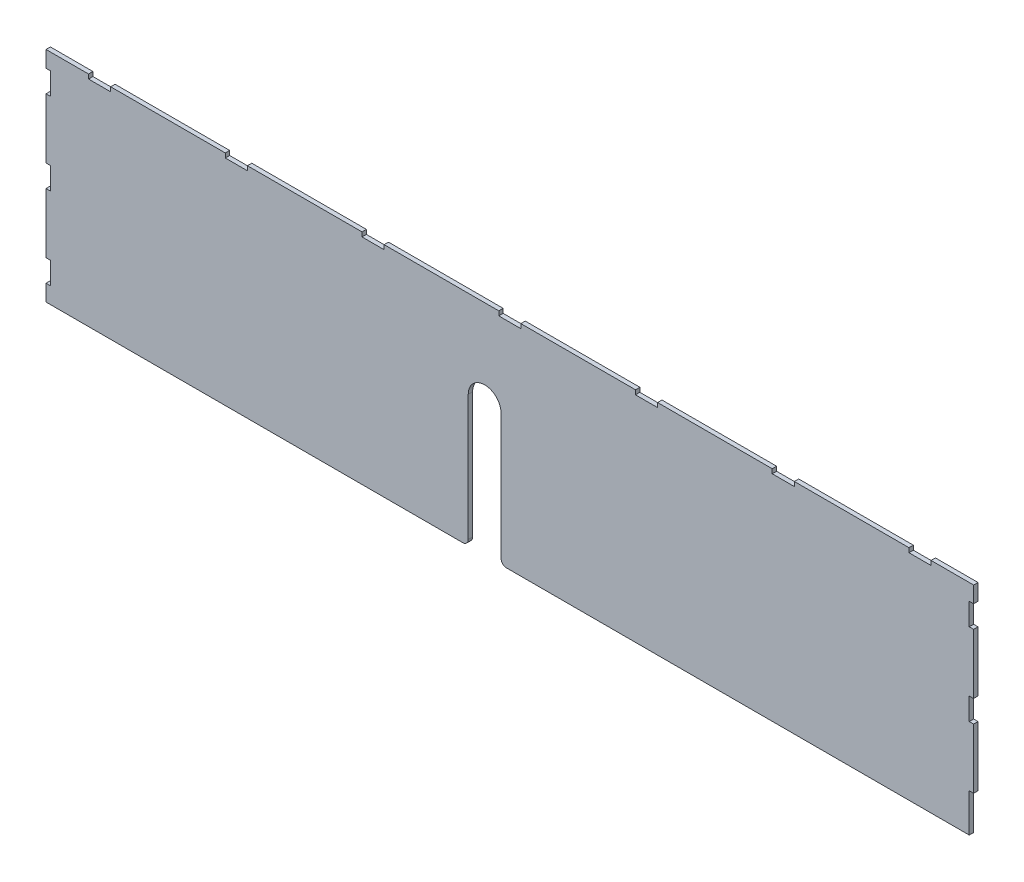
ISO-10303-21;
HEADER;
FILE_DESCRIPTION(('STEP AP214'),'2;1');
FILE_NAME('part.step','',(''),(''),'','','');
FILE_SCHEMA(('AUTOMOTIVE_DESIGN { 1 0 10303 214 1 1 1 1 }'));
ENDSEC;
DATA;
#1=APPLICATION_CONTEXT('core data for automotive mechanical design processes');
#2=APPLICATION_PROTOCOL_DEFINITION('international standard','automotive_design',2000,#1);
#3=PRODUCT_CONTEXT('',#1,'mechanical');
#4=PRODUCT('Part','Part','',(#3));
#5=PRODUCT_RELATED_PRODUCT_CATEGORY('part','',(#4));
#6=PRODUCT_DEFINITION_FORMATION('','',#4);
#7=PRODUCT_DEFINITION_CONTEXT('part definition',#1,'design');
#8=PRODUCT_DEFINITION('design','',#6,#7);
#9=PRODUCT_DEFINITION_SHAPE('','',#8);
#10=(LENGTH_UNIT() NAMED_UNIT(*) SI_UNIT(.MILLI.,.METRE.));
#11=(NAMED_UNIT(*) PLANE_ANGLE_UNIT() SI_UNIT($,.RADIAN.));
#12=(NAMED_UNIT(*) SI_UNIT($,.STERADIAN.) SOLID_ANGLE_UNIT());
#13=UNCERTAINTY_MEASURE_WITH_UNIT(LENGTH_MEASURE(1.E-05),#10,'distance_accuracy_value','');
#14=(GEOMETRIC_REPRESENTATION_CONTEXT(3) GLOBAL_UNCERTAINTY_ASSIGNED_CONTEXT((#13)) GLOBAL_UNIT_ASSIGNED_CONTEXT((#10,
#11,#12)) REPRESENTATION_CONTEXT('',''));
#15=CARTESIAN_POINT('',(0.,0.,0.));
#16=DIRECTION('',(0.,0.,1.));
#17=DIRECTION('',(1.,0.,0.));
#18=AXIS2_PLACEMENT_3D('',#15,#16,#17);
#19=CARTESIAN_POINT('',(-424.,-100.,4.));
#20=DIRECTION('',(0.,1.,0.));
#21=DIRECTION('',(0.,0.,1.));
#22=AXIS2_PLACEMENT_3D('',#19,#20,#21);
#23=PLANE('',#22);
#24=DIRECTION('',(1.,0.,0.));
#25=VECTOR('',#24,1.);
#26=CARTESIAN_POINT('',(-424.,-100.,0.));
#27=LINE('',#26,#25);
#28=CARTESIAN_POINT('',(-424.,-100.,0.));
#29=VERTEX_POINT('',#28);
#30=CARTESIAN_POINT('',(-43.,-100.,0.));
#31=VERTEX_POINT('',#30);
#32=EDGE_CURVE('E780',#29,#31,#27,.T.);
#33=ORIENTED_EDGE('',*,*,#32,.T.);
#34=DIRECTION('',(0.,0.,1.));
#35=VECTOR('',#34,1.);
#36=CARTESIAN_POINT('',(-43.,-100.,4.));
#37=LINE('',#36,#35);
#38=CARTESIAN_POINT('',(-43.,-100.,4.));
#39=VERTEX_POINT('',#38);
#40=EDGE_CURVE('E48',#31,#39,#37,.T.);
#41=ORIENTED_EDGE('',*,*,#40,.T.);
#42=DIRECTION('',(1.,0.,0.));
#43=VECTOR('',#42,1.);
#44=CARTESIAN_POINT('',(-424.,-100.,4.));
#45=LINE('',#44,#43);
#46=CARTESIAN_POINT('',(-424.,-100.,4.));
#47=VERTEX_POINT('',#46);
#48=EDGE_CURVE('E793',#47,#39,#45,.T.);
#49=ORIENTED_EDGE('',*,*,#48,.F.);
#50=DIRECTION('',(0.,0.,-1.));
#51=VECTOR('',#50,1.);
#52=CARTESIAN_POINT('',(-424.,-100.,4.));
#53=LINE('',#52,#51);
#54=EDGE_CURVE('E796',#47,#29,#53,.T.);
#55=ORIENTED_EDGE('',*,*,#54,.T.);
#56=EDGE_LOOP('',(#33,#41,#49,#55));
#57=FACE_BOUND('',#56,.T.);
#58=ADVANCED_FACE('F40',(#57),#23,.F.);
#59=CARTESIAN_POINT('',(424.,-100.,4.));
#60=DIRECTION('',(-1.,0.,0.));
#61=DIRECTION('',(0.,0.,1.));
#62=AXIS2_PLACEMENT_3D('',#59,#60,#61);
#63=PLANE('',#62);
#64=DIRECTION('',(0.,1.,0.));
#65=VECTOR('',#64,1.);
#66=CARTESIAN_POINT('',(424.,-100.,4.));
#67=LINE('',#66,#65);
#68=CARTESIAN_POINT('',(424.,-64.9,4.));
#69=VERTEX_POINT('',#68);
#70=CARTESIAN_POINT('',(424.,-10.1,4.));
#71=VERTEX_POINT('',#70);
#72=EDGE_CURVE('E781',#69,#71,#67,.T.);
#73=ORIENTED_EDGE('',*,*,#72,.F.);
#74=DIRECTION('',(0.,0.,1.));
#75=VECTOR('',#74,1.);
#76=CARTESIAN_POINT('',(424.,-64.9,0.));
#77=LINE('',#76,#75);
#78=CARTESIAN_POINT('',(424.,-64.9,0.));
#79=VERTEX_POINT('',#78);
#80=EDGE_CURVE('E609',#79,#69,#77,.T.);
#81=ORIENTED_EDGE('',*,*,#80,.F.);
#82=DIRECTION('',(0.,1.,0.));
#83=VECTOR('',#82,1.);
#84=CARTESIAN_POINT('',(424.,-100.,0.));
#85=LINE('',#84,#83);
#86=CARTESIAN_POINT('',(424.,-10.1,0.));
#87=VERTEX_POINT('',#86);
#88=EDGE_CURVE('E799',#79,#87,#85,.T.);
#89=ORIENTED_EDGE('',*,*,#88,.T.);
#90=DIRECTION('',(0.,0.,1.));
#91=VECTOR('',#90,1.);
#92=CARTESIAN_POINT('',(424.,-10.1,0.));
#93=LINE('',#92,#91);
#94=EDGE_CURVE('E716',#87,#71,#93,.T.);
#95=ORIENTED_EDGE('',*,*,#94,.T.);
#96=EDGE_LOOP('',(#73,#81,#89,#95));
#97=FACE_BOUND('',#96,.T.);
#98=ADVANCED_FACE('F893',(#97),#63,.F.);
#99=CARTESIAN_POINT('',(424.,10.1,4.));
#100=VERTEX_POINT('',#99);
#101=CARTESIAN_POINT('',(424.,64.9000000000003,4.));
#102=VERTEX_POINT('',#101);
#103=EDGE_CURVE('E779',#100,#102,#67,.T.);
#104=ORIENTED_EDGE('',*,*,#103,.F.);
#105=DIRECTION('',(0.,0.,1.));
#106=VECTOR('',#105,1.);
#107=CARTESIAN_POINT('',(424.,10.1,0.));
#108=LINE('',#107,#106);
#109=CARTESIAN_POINT('',(424.,10.1,0.));
#110=VERTEX_POINT('',#109);
#111=EDGE_CURVE('E737',#110,#100,#108,.T.);
#112=ORIENTED_EDGE('',*,*,#111,.F.);
#113=CARTESIAN_POINT('',(424.,64.9000000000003,0.));
#114=VERTEX_POINT('',#113);
#115=EDGE_CURVE('E798',#110,#114,#85,.T.);
#116=ORIENTED_EDGE('',*,*,#115,.T.);
#117=DIRECTION('',(0.,0.,1.));
#118=VECTOR('',#117,1.);
#119=CARTESIAN_POINT('',(424.,64.9000000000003,0.));
#120=LINE('',#119,#118);
#121=EDGE_CURVE('E690',#114,#102,#120,.T.);
#122=ORIENTED_EDGE('',*,*,#121,.T.);
#123=EDGE_LOOP('',(#104,#112,#116,#122));
#124=FACE_BOUND('',#123,.T.);
#125=ADVANCED_FACE('F899',(#124),#63,.F.);
#126=CARTESIAN_POINT('',(-424.,100.,4.));
#127=DIRECTION('',(0.,-1.,0.));
#128=DIRECTION('',(0.,0.,-1.));
#129=AXIS2_PLACEMENT_3D('',#126,#127,#128);
#130=PLANE('',#129);
#131=DIRECTION('',(-1.,0.,0.));
#132=VECTOR('',#131,1.);
#133=CARTESIAN_POINT('',(-424.,100.,4.));
#134=LINE('',#133,#132);
#135=CARTESIAN_POINT('',(-260.1,100.,4.));
#136=VERTEX_POINT('',#135);
#137=CARTESIAN_POINT('',(-364.9,100.,4.));
#138=VERTEX_POINT('',#137);
#139=EDGE_CURVE('E1006',#136,#138,#134,.T.);
#140=ORIENTED_EDGE('',*,*,#139,.F.);
#141=DIRECTION('',(0.,0.,1.));
#142=VECTOR('',#141,1.);
#143=CARTESIAN_POINT('',(-260.1,100.,0.));
#144=LINE('',#143,#142);
#145=CARTESIAN_POINT('',(-260.1,100.,0.));
#146=VERTEX_POINT('',#145);
#147=EDGE_CURVE('E613',#146,#136,#144,.T.);
#148=ORIENTED_EDGE('',*,*,#147,.F.);
#149=DIRECTION('',(-1.,0.,0.));
#150=VECTOR('',#149,1.);
#151=CARTESIAN_POINT('',(-424.,100.,0.));
#152=LINE('',#151,#150);
#153=CARTESIAN_POINT('',(-364.9,100.,0.));
#154=VERTEX_POINT('',#153);
#155=EDGE_CURVE('E974',#146,#154,#152,.T.);
#156=ORIENTED_EDGE('',*,*,#155,.T.);
#157=DIRECTION('',(0.,0.,1.));
#158=VECTOR('',#157,1.);
#159=CARTESIAN_POINT('',(-364.9,100.,0.));
#160=LINE('',#159,#158);
#161=EDGE_CURVE('E572',#154,#138,#160,.T.);
#162=ORIENTED_EDGE('',*,*,#161,.T.);
#163=EDGE_LOOP('',(#140,#148,#156,#162));
#164=FACE_BOUND('',#163,.T.);
#165=ADVANCED_FACE('F936',(#164),#130,.F.);
#166=CARTESIAN_POINT('',(-385.1,100.,4.));
#167=VERTEX_POINT('',#166);
#168=CARTESIAN_POINT('',(-424.,100.,4.));
#169=VERTEX_POINT('',#168);
#170=EDGE_CURVE('E787',#167,#169,#134,.T.);
#171=ORIENTED_EDGE('',*,*,#170,.F.);
#172=DIRECTION('',(0.,0.,1.));
#173=VECTOR('',#172,1.);
#174=CARTESIAN_POINT('',(-385.1,100.,0.));
#175=LINE('',#174,#173);
#176=CARTESIAN_POINT('',(-385.1,100.,0.));
#177=VERTEX_POINT('',#176);
#178=EDGE_CURVE('E569',#177,#167,#175,.T.);
#179=ORIENTED_EDGE('',*,*,#178,.F.);
#180=CARTESIAN_POINT('',(-424.,100.,0.));
#181=VERTEX_POINT('',#180);
#182=EDGE_CURVE('E805',#177,#181,#152,.T.);
#183=ORIENTED_EDGE('',*,*,#182,.T.);
#184=DIRECTION('',(0.,0.,-1.));
#185=VECTOR('',#184,1.);
#186=CARTESIAN_POINT('',(-424.,100.,4.));
#187=LINE('',#186,#185);
#188=EDGE_CURVE('E814',#169,#181,#187,.T.);
#189=ORIENTED_EDGE('',*,*,#188,.F.);
#190=EDGE_LOOP('',(#171,#179,#183,#189));
#191=FACE_BOUND('',#190,.T.);
#192=ADVANCED_FACE('F941',(#191),#130,.F.);
#193=CARTESIAN_POINT('',(-135.1,100.,0.));
#194=VERTEX_POINT('',#193);
#195=CARTESIAN_POINT('',(-239.9,100.,0.));
#196=VERTEX_POINT('',#195);
#197=EDGE_CURVE('E969',#194,#196,#152,.T.);
#198=ORIENTED_EDGE('',*,*,#197,.T.);
#199=DIRECTION('',(0.,0.,1.));
#200=VECTOR('',#199,1.);
#201=CARTESIAN_POINT('',(-239.9,100.,0.));
#202=LINE('',#201,#200);
#203=CARTESIAN_POINT('',(-239.9,100.,4.));
#204=VERTEX_POINT('',#203);
#205=EDGE_CURVE('E641',#196,#204,#202,.T.);
#206=ORIENTED_EDGE('',*,*,#205,.T.);
#207=CARTESIAN_POINT('',(-135.1,100.,4.));
#208=VERTEX_POINT('',#207);
#209=EDGE_CURVE('E1010',#208,#204,#134,.T.);
#210=ORIENTED_EDGE('',*,*,#209,.F.);
#211=DIRECTION('',(0.,0.,1.));
#212=VECTOR('',#211,1.);
#213=CARTESIAN_POINT('',(-135.1,100.,0.));
#214=LINE('',#213,#212);
#215=EDGE_CURVE('E565',#194,#208,#214,.T.);
#216=ORIENTED_EDGE('',*,*,#215,.F.);
#217=EDGE_LOOP('',(#198,#206,#210,#216));
#218=FACE_BOUND('',#217,.T.);
#219=ADVANCED_FACE('F1497',(#218),#130,.F.);
#220=CARTESIAN_POINT('',(-10.1,100.,0.));
#221=VERTEX_POINT('',#220);
#222=CARTESIAN_POINT('',(-114.9,100.,0.));
#223=VERTEX_POINT('',#222);
#224=EDGE_CURVE('E964',#221,#223,#152,.T.);
#225=ORIENTED_EDGE('',*,*,#224,.T.);
#226=DIRECTION('',(0.,0.,1.));
#227=VECTOR('',#226,1.);
#228=CARTESIAN_POINT('',(-114.9,100.,0.));
#229=LINE('',#228,#227);
#230=CARTESIAN_POINT('',(-114.9,100.,4.));
#231=VERTEX_POINT('',#230);
#232=EDGE_CURVE('E596',#223,#231,#229,.T.);
#233=ORIENTED_EDGE('',*,*,#232,.T.);
#234=CARTESIAN_POINT('',(-10.1,100.,4.));
#235=VERTEX_POINT('',#234);
#236=EDGE_CURVE('E1015',#235,#231,#134,.T.);
#237=ORIENTED_EDGE('',*,*,#236,.F.);
#238=DIRECTION('',(0.,0.,1.));
#239=VECTOR('',#238,1.);
#240=CARTESIAN_POINT('',(-10.1,100.,0.));
#241=LINE('',#240,#239);
#242=EDGE_CURVE('E465',#221,#235,#241,.T.);
#243=ORIENTED_EDGE('',*,*,#242,.F.);
#244=EDGE_LOOP('',(#225,#233,#237,#243));
#245=FACE_BOUND('',#244,.T.);
#246=ADVANCED_FACE('F1489',(#245),#130,.F.);
#247=CARTESIAN_POINT('',(114.9,100.,0.));
#248=VERTEX_POINT('',#247);
#249=CARTESIAN_POINT('',(10.1,100.,0.));
#250=VERTEX_POINT('',#249);
#251=EDGE_CURVE('E960',#248,#250,#152,.T.);
#252=ORIENTED_EDGE('',*,*,#251,.T.);
#253=DIRECTION('',(0.,0.,1.));
#254=VECTOR('',#253,1.);
#255=CARTESIAN_POINT('',(10.1,100.,0.));
#256=LINE('',#255,#254);
#257=CARTESIAN_POINT('',(10.1,100.,4.));
#258=VERTEX_POINT('',#257);
#259=EDGE_CURVE('E468',#250,#258,#256,.T.);
#260=ORIENTED_EDGE('',*,*,#259,.T.);
#261=CARTESIAN_POINT('',(114.9,100.,4.));
#262=VERTEX_POINT('',#261);
#263=EDGE_CURVE('E1020',#262,#258,#134,.T.);
#264=ORIENTED_EDGE('',*,*,#263,.F.);
#265=DIRECTION('',(0.,0.,1.));
#266=VECTOR('',#265,1.);
#267=CARTESIAN_POINT('',(114.9,100.,0.));
#268=LINE('',#267,#266);
#269=EDGE_CURVE('E461',#248,#262,#268,.T.);
#270=ORIENTED_EDGE('',*,*,#269,.F.);
#271=EDGE_LOOP('',(#252,#260,#264,#270));
#272=FACE_BOUND('',#271,.T.);
#273=ADVANCED_FACE('F951',(#272),#130,.F.);
#274=CARTESIAN_POINT('',(239.9,100.,0.));
#275=VERTEX_POINT('',#274);
#276=CARTESIAN_POINT('',(135.1,100.,0.));
#277=VERTEX_POINT('',#276);
#278=EDGE_CURVE('E958',#275,#277,#152,.T.);
#279=ORIENTED_EDGE('',*,*,#278,.T.);
#280=DIRECTION('',(0.,0.,1.));
#281=VECTOR('',#280,1.);
#282=CARTESIAN_POINT('',(135.1,100.,0.));
#283=LINE('',#282,#281);
#284=CARTESIAN_POINT('',(135.1,100.,4.));
#285=VERTEX_POINT('',#284);
#286=EDGE_CURVE('E494',#277,#285,#283,.T.);
#287=ORIENTED_EDGE('',*,*,#286,.T.);
#288=CARTESIAN_POINT('',(239.9,100.,4.));
#289=VERTEX_POINT('',#288);
#290=EDGE_CURVE('E1025',#289,#285,#134,.T.);
#291=ORIENTED_EDGE('',*,*,#290,.F.);
#292=DIRECTION('',(0.,0.,1.));
#293=VECTOR('',#292,1.);
#294=CARTESIAN_POINT('',(239.9,100.,0.));
#295=LINE('',#294,#293);
#296=EDGE_CURVE('E489',#275,#289,#295,.T.);
#297=ORIENTED_EDGE('',*,*,#296,.F.);
#298=EDGE_LOOP('',(#279,#287,#291,#297));
#299=FACE_BOUND('',#298,.T.);
#300=ADVANCED_FACE('F944',(#299),#130,.F.);
#301=CARTESIAN_POINT('',(364.9,100.,0.));
#302=VERTEX_POINT('',#301);
#303=CARTESIAN_POINT('',(260.1,100.,0.));
#304=VERTEX_POINT('',#303);
#305=EDGE_CURVE('E804',#302,#304,#152,.T.);
#306=ORIENTED_EDGE('',*,*,#305,.T.);
#307=DIRECTION('',(0.,0.,1.));
#308=VECTOR('',#307,1.);
#309=CARTESIAN_POINT('',(260.1,100.,0.));
#310=LINE('',#309,#308);
#311=CARTESIAN_POINT('',(260.1,100.,4.));
#312=VERTEX_POINT('',#311);
#313=EDGE_CURVE('E520',#304,#312,#310,.T.);
#314=ORIENTED_EDGE('',*,*,#313,.T.);
#315=CARTESIAN_POINT('',(364.9,100.,4.));
#316=VERTEX_POINT('',#315);
#317=EDGE_CURVE('E786',#316,#312,#134,.T.);
#318=ORIENTED_EDGE('',*,*,#317,.F.);
#319=DIRECTION('',(0.,0.,1.));
#320=VECTOR('',#319,1.);
#321=CARTESIAN_POINT('',(364.9,100.,0.));
#322=LINE('',#321,#320);
#323=EDGE_CURVE('E515',#302,#316,#322,.T.);
#324=ORIENTED_EDGE('',*,*,#323,.F.);
#325=EDGE_LOOP('',(#306,#314,#318,#324));
#326=FACE_BOUND('',#325,.T.);
#327=ADVANCED_FACE('F937',(#326),#130,.F.);
#328=CARTESIAN_POINT('',(-424.,-100.,4.));
#329=DIRECTION('',(1.,0.,0.));
#330=DIRECTION('',(0.,0.,-1.));
#331=AXIS2_PLACEMENT_3D('',#328,#329,#330);
#332=PLANE('',#331);
#333=DIRECTION('',(0.,-1.,0.));
#334=VECTOR('',#333,1.);
#335=CARTESIAN_POINT('',(-424.,-100.,0.));
#336=LINE('',#335,#334);
#337=CARTESIAN_POINT('',(-424.,85.1,0.));
#338=VERTEX_POINT('',#337);
#339=EDGE_CURVE('E806',#181,#338,#336,.T.);
#340=ORIENTED_EDGE('',*,*,#339,.T.);
#341=DIRECTION('',(0.,0.,1.));
#342=VECTOR('',#341,1.);
#343=CARTESIAN_POINT('',(-424.,85.1,0.));
#344=LINE('',#343,#342);
#345=CARTESIAN_POINT('',(-424.,85.1,4.));
#346=VERTEX_POINT('',#345);
#347=EDGE_CURVE('E662',#338,#346,#344,.T.);
#348=ORIENTED_EDGE('',*,*,#347,.T.);
#349=DIRECTION('',(0.,-1.,0.));
#350=VECTOR('',#349,1.);
#351=CARTESIAN_POINT('',(-424.,-100.,4.));
#352=LINE('',#351,#350);
#353=EDGE_CURVE('E788',#169,#346,#352,.T.);
#354=ORIENTED_EDGE('',*,*,#353,.F.);
#355=ORIENTED_EDGE('',*,*,#188,.T.);
#356=EDGE_LOOP('',(#340,#348,#354,#355));
#357=FACE_BOUND('',#356,.T.);
#358=ADVANCED_FACE('F912',(#357),#332,.F.);
#359=CARTESIAN_POINT('',(-424.,64.9,4.));
#360=VERTEX_POINT('',#359);
#361=CARTESIAN_POINT('',(-424.,10.1,4.));
#362=VERTEX_POINT('',#361);
#363=EDGE_CURVE('E792',#360,#362,#352,.T.);
#364=ORIENTED_EDGE('',*,*,#363,.F.);
#365=DIRECTION('',(0.,0.,1.));
#366=VECTOR('',#365,1.);
#367=CARTESIAN_POINT('',(-424.,64.9,0.));
#368=LINE('',#367,#366);
#369=CARTESIAN_POINT('',(-424.,64.9,0.));
#370=VERTEX_POINT('',#369);
#371=EDGE_CURVE('E685',#370,#360,#368,.T.);
#372=ORIENTED_EDGE('',*,*,#371,.F.);
#373=CARTESIAN_POINT('',(-424.,10.1,0.));
#374=VERTEX_POINT('',#373);
#375=EDGE_CURVE('E810',#370,#374,#336,.T.);
#376=ORIENTED_EDGE('',*,*,#375,.T.);
#377=DIRECTION('',(0.,0.,1.));
#378=VECTOR('',#377,1.);
#379=CARTESIAN_POINT('',(-424.,10.1,0.));
#380=LINE('',#379,#378);
#381=EDGE_CURVE('E666',#374,#362,#380,.T.);
#382=ORIENTED_EDGE('',*,*,#381,.T.);
#383=EDGE_LOOP('',(#364,#372,#376,#382));
#384=FACE_BOUND('',#383,.T.);
#385=ADVANCED_FACE('F858',(#384),#332,.F.);
#386=CARTESIAN_POINT('',(-424.,-10.1,4.));
#387=VERTEX_POINT('',#386);
#388=CARTESIAN_POINT('',(-424.,-64.9,4.));
#389=VERTEX_POINT('',#388);
#390=EDGE_CURVE('E845',#387,#389,#352,.T.);
#391=ORIENTED_EDGE('',*,*,#390,.F.);
#392=DIRECTION('',(0.,0.,1.));
#393=VECTOR('',#392,1.);
#394=CARTESIAN_POINT('',(-424.,-10.1,0.));
#395=LINE('',#394,#393);
#396=CARTESIAN_POINT('',(-424.,-10.1,0.));
#397=VERTEX_POINT('',#396);
#398=EDGE_CURVE('E657',#397,#387,#395,.T.);
#399=ORIENTED_EDGE('',*,*,#398,.F.);
#400=CARTESIAN_POINT('',(-424.,-64.9,0.));
#401=VERTEX_POINT('',#400);
#402=EDGE_CURVE('E848',#397,#401,#336,.T.);
#403=ORIENTED_EDGE('',*,*,#402,.T.);
#404=DIRECTION('',(0.,0.,1.));
#405=VECTOR('',#404,1.);
#406=CARTESIAN_POINT('',(-424.,-64.9,0.));
#407=LINE('',#406,#405);
#408=EDGE_CURVE('E768',#401,#389,#407,.T.);
#409=ORIENTED_EDGE('',*,*,#408,.T.);
#410=EDGE_LOOP('',(#391,#399,#403,#409));
#411=FACE_BOUND('',#410,.T.);
#412=ADVANCED_FACE('F871',(#411),#332,.F.);
#413=CARTESIAN_POINT('',(424.,85.1,4.));
#414=VERTEX_POINT('',#413);
#415=CARTESIAN_POINT('',(424.,100.,4.));
#416=VERTEX_POINT('',#415);
#417=EDGE_CURVE('E777',#414,#416,#67,.T.);
#418=ORIENTED_EDGE('',*,*,#417,.F.);
#419=DIRECTION('',(0.,0.,1.));
#420=VECTOR('',#419,1.);
#421=CARTESIAN_POINT('',(424.,85.1,0.));
#422=LINE('',#421,#420);
#423=CARTESIAN_POINT('',(424.,85.1,0.));
#424=VERTEX_POINT('',#423);
#425=EDGE_CURVE('E711',#424,#414,#422,.T.);
#426=ORIENTED_EDGE('',*,*,#425,.F.);
#427=CARTESIAN_POINT('',(424.,100.,0.));
#428=VERTEX_POINT('',#427);
#429=EDGE_CURVE('E771',#424,#428,#85,.T.);
#430=ORIENTED_EDGE('',*,*,#429,.T.);
#431=DIRECTION('',(0.,0.,-1.));
#432=VECTOR('',#431,1.);
#433=CARTESIAN_POINT('',(424.,100.,4.));
#434=LINE('',#433,#432);
#435=EDGE_CURVE('E817',#416,#428,#434,.T.);
#436=ORIENTED_EDGE('',*,*,#435,.F.);
#437=EDGE_LOOP('',(#418,#426,#430,#436));
#438=FACE_BOUND('',#437,.T.);
#439=ADVANCED_FACE('F902',(#438),#63,.F.);
#440=CARTESIAN_POINT('',(385.1,100.,0.));
#441=VERTEX_POINT('',#440);
#442=EDGE_CURVE('E800',#428,#441,#152,.T.);
#443=ORIENTED_EDGE('',*,*,#442,.T.);
#444=DIRECTION('',(0.,0.,1.));
#445=VECTOR('',#444,1.);
#446=CARTESIAN_POINT('',(385.1,100.,0.));
#447=LINE('',#446,#445);
#448=CARTESIAN_POINT('',(385.1,100.,4.));
#449=VERTEX_POINT('',#448);
#450=EDGE_CURVE('E544',#441,#449,#447,.T.);
#451=ORIENTED_EDGE('',*,*,#450,.T.);
#452=EDGE_CURVE('E782',#416,#449,#134,.T.);
#453=ORIENTED_EDGE('',*,*,#452,.F.);
#454=ORIENTED_EDGE('',*,*,#435,.T.);
#455=EDGE_LOOP('',(#443,#451,#453,#454));
#456=FACE_BOUND('',#455,.T.);
#457=ADVANCED_FACE('F911',(#456),#130,.F.);
#458=CARTESIAN_POINT('',(-424.,-85.1,4.));
#459=VERTEX_POINT('',#458);
#460=EDGE_CURVE('E785',#459,#47,#352,.T.);
#461=ORIENTED_EDGE('',*,*,#460,.F.);
#462=DIRECTION('',(0.,0.,1.));
#463=VECTOR('',#462,1.);
#464=CARTESIAN_POINT('',(-424.,-85.1,0.));
#465=LINE('',#464,#463);
#466=CARTESIAN_POINT('',(-424.,-85.1,0.));
#467=VERTEX_POINT('',#466);
#468=EDGE_CURVE('E761',#467,#459,#465,.T.);
#469=ORIENTED_EDGE('',*,*,#468,.F.);
#470=EDGE_CURVE('E803',#467,#29,#336,.T.);
#471=ORIENTED_EDGE('',*,*,#470,.T.);
#472=ORIENTED_EDGE('',*,*,#54,.F.);
#473=EDGE_LOOP('',(#461,#469,#471,#472));
#474=FACE_BOUND('',#473,.T.);
#475=ADVANCED_FACE('F846',(#474),#332,.F.);
#476=CARTESIAN_POINT('',(-3.,-100.,4.));
#477=VERTEX_POINT('',#476);
#478=CARTESIAN_POINT('',(420.,-100.,4.));
#479=VERTEX_POINT('',#478);
#480=EDGE_CURVE('E791',#477,#479,#45,.T.);
#481=ORIENTED_EDGE('',*,*,#480,.F.);
#482=DIRECTION('',(0.,0.,1.));
#483=VECTOR('',#482,1.);
#484=CARTESIAN_POINT('',(-3.,-100.,4.));
#485=LINE('',#484,#483);
#486=CARTESIAN_POINT('',(-3.,-100.,0.));
#487=VERTEX_POINT('',#486);
#488=EDGE_CURVE('E827',#477,#487,#485,.F.);
#489=ORIENTED_EDGE('',*,*,#488,.T.);
#490=CARTESIAN_POINT('',(420.,-100.,0.));
#491=VERTEX_POINT('',#490);
#492=EDGE_CURVE('E809',#487,#491,#27,.T.);
#493=ORIENTED_EDGE('',*,*,#492,.T.);
#494=DIRECTION('',(0.,0.,1.));
#495=VECTOR('',#494,1.);
#496=CARTESIAN_POINT('',(420.,-100.,0.));
#497=LINE('',#496,#495);
#498=EDGE_CURVE('E616',#491,#479,#497,.T.);
#499=ORIENTED_EDGE('',*,*,#498,.T.);
#500=EDGE_LOOP('',(#481,#489,#493,#499));
#501=FACE_BOUND('',#500,.T.);
#502=ADVANCED_FACE('F895',(#501),#23,.F.);
#503=CARTESIAN_POINT('',(0.,0.,4.));
#504=DIRECTION('',(0.,0.,-1.));
#505=DIRECTION('',(-1.,0.,0.));
#506=AXIS2_PLACEMENT_3D('',#503,#504,#505);
#507=PLANE('',#506);
#508=DIRECTION('',(0.,1.,0.));
#509=VECTOR('',#508,1.);
#510=CARTESIAN_POINT('',(-8.00000000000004,20.,4.));
#511=LINE('',#510,#509);
#512=CARTESIAN_POINT('',(-8.00000000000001,-95.,4.));
#513=VERTEX_POINT('',#512);
#514=CARTESIAN_POINT('',(-8.00000000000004,20.,4.));
#515=VERTEX_POINT('',#514);
#516=EDGE_CURVE('E441',#513,#515,#511,.T.);
#517=ORIENTED_EDGE('',*,*,#516,.F.);
#518=CARTESIAN_POINT('',(-3.00000000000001,-95.,4.));
#519=DIRECTION('',(0.,0.,-1.));
#520=DIRECTION('',(-1.,0.,0.));
#521=AXIS2_PLACEMENT_3D('',#518,#519,#520);
#522=CIRCLE('',#521,5.);
#523=EDGE_CURVE('E825',#513,#477,#522,.F.);
#524=ORIENTED_EDGE('',*,*,#523,.T.);
#525=ORIENTED_EDGE('',*,*,#480,.T.);
#526=DIRECTION('',(0.,-1.,0.));
#527=VECTOR('',#526,1.);
#528=CARTESIAN_POINT('',(420.,-64.9,4.));
#529=LINE('',#528,#527);
#530=CARTESIAN_POINT('',(420.,-64.9,4.));
#531=VERTEX_POINT('',#530);
#532=EDGE_CURVE('E606',#531,#479,#529,.T.);
#533=ORIENTED_EDGE('',*,*,#532,.F.);
#534=DIRECTION('',(-1.,0.,0.));
#535=VECTOR('',#534,1.);
#536=CARTESIAN_POINT('',(424.,-64.9,4.));
#537=LINE('',#536,#535);
#538=EDGE_CURVE('E610',#69,#531,#537,.T.);
#539=ORIENTED_EDGE('',*,*,#538,.F.);
#540=ORIENTED_EDGE('',*,*,#72,.T.);
#541=DIRECTION('',(1.,0.,0.));
#542=VECTOR('',#541,1.);
#543=CARTESIAN_POINT('',(424.,-10.1,4.));
#544=LINE('',#543,#542);
#545=CARTESIAN_POINT('',(420.,-10.1,4.));
#546=VERTEX_POINT('',#545);
#547=EDGE_CURVE('E731',#546,#71,#544,.T.);
#548=ORIENTED_EDGE('',*,*,#547,.F.);
#549=DIRECTION('',(0.,-1.,0.));
#550=VECTOR('',#549,1.);
#551=CARTESIAN_POINT('',(420.,10.1,4.));
#552=LINE('',#551,#550);
#553=CARTESIAN_POINT('',(420.,10.1,4.));
#554=VERTEX_POINT('',#553);
#555=EDGE_CURVE('E740',#554,#546,#552,.T.);
#556=ORIENTED_EDGE('',*,*,#555,.F.);
#557=DIRECTION('',(-1.,0.,0.));
#558=VECTOR('',#557,1.);
#559=CARTESIAN_POINT('',(424.,10.1,4.));
#560=LINE('',#559,#558);
#561=EDGE_CURVE('E619',#100,#554,#560,.T.);
#562=ORIENTED_EDGE('',*,*,#561,.F.);
#563=ORIENTED_EDGE('',*,*,#103,.T.);
#564=DIRECTION('',(1.,0.,0.));
#565=VECTOR('',#564,1.);
#566=CARTESIAN_POINT('',(424.,64.9000000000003,4.));
#567=LINE('',#566,#565);
#568=CARTESIAN_POINT('',(420.,64.9000000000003,4.));
#569=VERTEX_POINT('',#568);
#570=EDGE_CURVE('E705',#569,#102,#567,.T.);
#571=ORIENTED_EDGE('',*,*,#570,.F.);
#572=DIRECTION('',(0.,-1.,0.));
#573=VECTOR('',#572,1.);
#574=CARTESIAN_POINT('',(420.,85.1,4.));
#575=LINE('',#574,#573);
#576=CARTESIAN_POINT('',(420.,85.1,4.));
#577=VERTEX_POINT('',#576);
#578=EDGE_CURVE('E715',#577,#569,#575,.T.);
#579=ORIENTED_EDGE('',*,*,#578,.F.);
#580=DIRECTION('',(-1.,0.,0.));
#581=VECTOR('',#580,1.);
#582=CARTESIAN_POINT('',(424.,85.1,4.));
#583=LINE('',#582,#581);
#584=EDGE_CURVE('E712',#414,#577,#583,.T.);
#585=ORIENTED_EDGE('',*,*,#584,.F.);
#586=ORIENTED_EDGE('',*,*,#417,.T.);
#587=ORIENTED_EDGE('',*,*,#452,.T.);
#588=DIRECTION('',(0.,1.,0.));
#589=VECTOR('',#588,1.);
#590=CARTESIAN_POINT('',(385.1,100.,4.));
#591=LINE('',#590,#589);
#592=CARTESIAN_POINT('',(385.1,96.,4.));
#593=VERTEX_POINT('',#592);
#594=EDGE_CURVE('E530',#593,#449,#591,.T.);
#595=ORIENTED_EDGE('',*,*,#594,.F.);
#596=DIRECTION('',(1.,0.,0.));
#597=VECTOR('',#596,1.);
#598=CARTESIAN_POINT('',(364.9,96.,4.));
#599=LINE('',#598,#597);
#600=CARTESIAN_POINT('',(364.9,96.,4.));
#601=VERTEX_POINT('',#600);
#602=EDGE_CURVE('E539',#601,#593,#599,.T.);
#603=ORIENTED_EDGE('',*,*,#602,.F.);
#604=DIRECTION('',(0.,-1.,0.));
#605=VECTOR('',#604,1.);
#606=CARTESIAN_POINT('',(364.9,100.,4.));
#607=LINE('',#606,#605);
#608=EDGE_CURVE('E427',#316,#601,#607,.T.);
#609=ORIENTED_EDGE('',*,*,#608,.F.);
#610=ORIENTED_EDGE('',*,*,#317,.T.);
#611=DIRECTION('',(0.,1.,0.));
#612=VECTOR('',#611,1.);
#613=CARTESIAN_POINT('',(260.1,100.,4.));
#614=LINE('',#613,#612);
#615=CARTESIAN_POINT('',(260.1,96.,4.));
#616=VERTEX_POINT('',#615);
#617=EDGE_CURVE('E504',#616,#312,#614,.T.);
#618=ORIENTED_EDGE('',*,*,#617,.F.);
#619=DIRECTION('',(1.,0.,0.));
#620=VECTOR('',#619,1.);
#621=CARTESIAN_POINT('',(239.9,96.,4.));
#622=LINE('',#621,#620);
#623=CARTESIAN_POINT('',(239.9,96.,4.));
#624=VERTEX_POINT('',#623);
#625=EDGE_CURVE('E514',#624,#616,#622,.T.);
#626=ORIENTED_EDGE('',*,*,#625,.F.);
#627=DIRECTION('',(0.,-1.,0.));
#628=VECTOR('',#627,1.);
#629=CARTESIAN_POINT('',(239.9,100.,4.));
#630=LINE('',#629,#628);
#631=EDGE_CURVE('E511',#289,#624,#630,.T.);
#632=ORIENTED_EDGE('',*,*,#631,.F.);
#633=ORIENTED_EDGE('',*,*,#290,.T.);
#634=DIRECTION('',(0.,1.,0.));
#635=VECTOR('',#634,1.);
#636=CARTESIAN_POINT('',(135.1,100.,4.));
#637=LINE('',#636,#635);
#638=CARTESIAN_POINT('',(135.1,96.,4.));
#639=VERTEX_POINT('',#638);
#640=EDGE_CURVE('E478',#639,#285,#637,.T.);
#641=ORIENTED_EDGE('',*,*,#640,.F.);
#642=DIRECTION('',(1.,0.,0.));
#643=VECTOR('',#642,1.);
#644=CARTESIAN_POINT('',(114.9,96.,4.));
#645=LINE('',#644,#643);
#646=CARTESIAN_POINT('',(114.9,96.,4.));
#647=VERTEX_POINT('',#646);
#648=EDGE_CURVE('E488',#647,#639,#645,.T.);
#649=ORIENTED_EDGE('',*,*,#648,.F.);
#650=DIRECTION('',(0.,-1.,0.));
#651=VECTOR('',#650,1.);
#652=CARTESIAN_POINT('',(114.9,100.,4.));
#653=LINE('',#652,#651);
#654=EDGE_CURVE('E485',#262,#647,#653,.T.);
#655=ORIENTED_EDGE('',*,*,#654,.F.);
#656=ORIENTED_EDGE('',*,*,#263,.T.);
#657=DIRECTION('',(0.,1.,0.));
#658=VECTOR('',#657,1.);
#659=CARTESIAN_POINT('',(10.1,100.,4.));
#660=LINE('',#659,#658);
#661=CARTESIAN_POINT('',(10.1,96.,4.));
#662=VERTEX_POINT('',#661);
#663=EDGE_CURVE('E450',#662,#258,#660,.T.);
#664=ORIENTED_EDGE('',*,*,#663,.F.);
#665=DIRECTION('',(1.,0.,0.));
#666=VECTOR('',#665,1.);
#667=CARTESIAN_POINT('',(-10.1,96.,4.));
#668=LINE('',#667,#666);
#669=CARTESIAN_POINT('',(-10.1,96.,4.));
#670=VERTEX_POINT('',#669);
#671=EDGE_CURVE('E460',#670,#662,#668,.T.);
#672=ORIENTED_EDGE('',*,*,#671,.F.);
#673=DIRECTION('',(0.,-1.,0.));
#674=VECTOR('',#673,1.);
#675=CARTESIAN_POINT('',(-10.1,100.,4.));
#676=LINE('',#675,#674);
#677=EDGE_CURVE('E457',#235,#670,#676,.T.);
#678=ORIENTED_EDGE('',*,*,#677,.F.);
#679=ORIENTED_EDGE('',*,*,#236,.T.);
#680=DIRECTION('',(0.,1.,0.));
#681=VECTOR('',#680,1.);
#682=CARTESIAN_POINT('',(-114.9,100.,4.));
#683=LINE('',#682,#681);
#684=CARTESIAN_POINT('',(-114.9,96.,4.));
#685=VERTEX_POINT('',#684);
#686=EDGE_CURVE('E582',#685,#231,#683,.T.);
#687=ORIENTED_EDGE('',*,*,#686,.F.);
#688=DIRECTION('',(1.,0.,0.));
#689=VECTOR('',#688,1.);
#690=CARTESIAN_POINT('',(-135.1,96.,4.));
#691=LINE('',#690,#689);
#692=CARTESIAN_POINT('',(-135.1,96.,4.));
#693=VERTEX_POINT('',#692);
#694=EDGE_CURVE('E591',#693,#685,#691,.T.);
#695=ORIENTED_EDGE('',*,*,#694,.F.);
#696=DIRECTION('',(0.,-1.,0.));
#697=VECTOR('',#696,1.);
#698=CARTESIAN_POINT('',(-135.1,100.,4.));
#699=LINE('',#698,#697);
#700=EDGE_CURVE('E467',#208,#693,#699,.T.);
#701=ORIENTED_EDGE('',*,*,#700,.F.);
#702=ORIENTED_EDGE('',*,*,#209,.T.);
#703=DIRECTION('',(0.,1.,0.));
#704=VECTOR('',#703,1.);
#705=CARTESIAN_POINT('',(-239.9,100.,4.));
#706=LINE('',#705,#704);
#707=CARTESIAN_POINT('',(-239.9,96.,4.));
#708=VERTEX_POINT('',#707);
#709=EDGE_CURVE('E627',#708,#204,#706,.T.);
#710=ORIENTED_EDGE('',*,*,#709,.F.);
#711=DIRECTION('',(1.,0.,0.));
#712=VECTOR('',#711,1.);
#713=CARTESIAN_POINT('',(-260.1,96.,4.));
#714=LINE('',#713,#712);
#715=CARTESIAN_POINT('',(-260.1,96.,4.));
#716=VERTEX_POINT('',#715);
#717=EDGE_CURVE('E636',#716,#708,#714,.T.);
#718=ORIENTED_EDGE('',*,*,#717,.F.);
#719=DIRECTION('',(0.,-1.,0.));
#720=VECTOR('',#719,1.);
#721=CARTESIAN_POINT('',(-260.1,100.,4.));
#722=LINE('',#721,#720);
#723=EDGE_CURVE('E571',#136,#716,#722,.T.);
#724=ORIENTED_EDGE('',*,*,#723,.F.);
#725=ORIENTED_EDGE('',*,*,#139,.T.);
#726=DIRECTION('',(0.,1.,0.));
#727=VECTOR('',#726,1.);
#728=CARTESIAN_POINT('',(-364.9,100.,4.));
#729=LINE('',#728,#727);
#730=CARTESIAN_POINT('',(-364.9,96.,4.));
#731=VERTEX_POINT('',#730);
#732=EDGE_CURVE('E554',#731,#138,#729,.T.);
#733=ORIENTED_EDGE('',*,*,#732,.F.);
#734=DIRECTION('',(1.,0.,0.));
#735=VECTOR('',#734,1.);
#736=CARTESIAN_POINT('',(-385.1,96.,4.));
#737=LINE('',#736,#735);
#738=CARTESIAN_POINT('',(-385.1,96.,4.));
#739=VERTEX_POINT('',#738);
#740=EDGE_CURVE('E564',#739,#731,#737,.T.);
#741=ORIENTED_EDGE('',*,*,#740,.F.);
#742=DIRECTION('',(0.,-1.,0.));
#743=VECTOR('',#742,1.);
#744=CARTESIAN_POINT('',(-385.1,100.,4.));
#745=LINE('',#744,#743);
#746=EDGE_CURVE('E561',#167,#739,#745,.T.);
#747=ORIENTED_EDGE('',*,*,#746,.F.);
#748=ORIENTED_EDGE('',*,*,#170,.T.);
#749=ORIENTED_EDGE('',*,*,#353,.T.);
#750=DIRECTION('',(-1.,0.,0.));
#751=VECTOR('',#750,1.);
#752=CARTESIAN_POINT('',(-424.,85.1,4.));
#753=LINE('',#752,#751);
#754=CARTESIAN_POINT('',(-420.,85.1,4.));
#755=VERTEX_POINT('',#754);
#756=EDGE_CURVE('E679',#755,#346,#753,.T.);
#757=ORIENTED_EDGE('',*,*,#756,.F.);
#758=DIRECTION('',(0.,1.,0.));
#759=VECTOR('',#758,1.);
#760=CARTESIAN_POINT('',(-420.,85.1,4.));
#761=LINE('',#760,#759);
#762=CARTESIAN_POINT('',(-420.,64.9,4.));
#763=VERTEX_POINT('',#762);
#764=EDGE_CURVE('E689',#763,#755,#761,.T.);
#765=ORIENTED_EDGE('',*,*,#764,.F.);
#766=DIRECTION('',(1.,0.,0.));
#767=VECTOR('',#766,1.);
#768=CARTESIAN_POINT('',(-424.,64.9,4.));
#769=LINE('',#768,#767);
#770=EDGE_CURVE('E686',#360,#763,#769,.T.);
#771=ORIENTED_EDGE('',*,*,#770,.F.);
#772=ORIENTED_EDGE('',*,*,#363,.T.);
#773=DIRECTION('',(-1.,0.,0.));
#774=VECTOR('',#773,1.);
#775=CARTESIAN_POINT('',(-424.,10.1,4.));
#776=LINE('',#775,#774);
#777=CARTESIAN_POINT('',(-420.,10.1,4.));
#778=VERTEX_POINT('',#777);
#779=EDGE_CURVE('E651',#778,#362,#776,.T.);
#780=ORIENTED_EDGE('',*,*,#779,.F.);
#781=DIRECTION('',(0.,1.,0.));
#782=VECTOR('',#781,1.);
#783=CARTESIAN_POINT('',(-420.,-10.1,4.));
#784=LINE('',#783,#782);
#785=CARTESIAN_POINT('',(-420.,-10.1,4.));
#786=VERTEX_POINT('',#785);
#787=EDGE_CURVE('E661',#786,#778,#784,.T.);
#788=ORIENTED_EDGE('',*,*,#787,.F.);
#789=DIRECTION('',(1.,0.,0.));
#790=VECTOR('',#789,1.);
#791=CARTESIAN_POINT('',(-424.,-10.1,4.));
#792=LINE('',#791,#790);
#793=EDGE_CURVE('E658',#387,#786,#792,.T.);
#794=ORIENTED_EDGE('',*,*,#793,.F.);
#795=ORIENTED_EDGE('',*,*,#390,.T.);
#796=DIRECTION('',(-1.,0.,0.));
#797=VECTOR('',#796,1.);
#798=CARTESIAN_POINT('',(-424.,-64.9,4.));
#799=LINE('',#798,#797);
#800=CARTESIAN_POINT('',(-420.,-64.9,4.));
#801=VERTEX_POINT('',#800);
#802=EDGE_CURVE('E755',#801,#389,#799,.T.);
#803=ORIENTED_EDGE('',*,*,#802,.F.);
#804=DIRECTION('',(0.,1.,0.));
#805=VECTOR('',#804,1.);
#806=CARTESIAN_POINT('',(-420.,-85.1,4.));
#807=LINE('',#806,#805);
#808=CARTESIAN_POINT('',(-420.,-85.1,4.));
#809=VERTEX_POINT('',#808);
#810=EDGE_CURVE('E764',#809,#801,#807,.T.);
#811=ORIENTED_EDGE('',*,*,#810,.F.);
#812=DIRECTION('',(1.,0.,0.));
#813=VECTOR('',#812,1.);
#814=CARTESIAN_POINT('',(-424.,-85.1,4.));
#815=LINE('',#814,#813);
#816=EDGE_CURVE('E669',#459,#809,#815,.T.);
#817=ORIENTED_EDGE('',*,*,#816,.F.);
#818=ORIENTED_EDGE('',*,*,#460,.T.);
#819=ORIENTED_EDGE('',*,*,#48,.T.);
#820=CARTESIAN_POINT('',(-43.,-95.,4.));
#821=DIRECTION('',(0.,0.,-1.));
#822=DIRECTION('',(-1.,0.,0.));
#823=AXIS2_PLACEMENT_3D('',#820,#821,#822);
#824=CIRCLE('',#823,5.);
#825=CARTESIAN_POINT('',(-38.,-95.,4.));
#826=VERTEX_POINT('',#825);
#827=EDGE_CURVE('E823',#39,#826,#824,.F.);
#828=ORIENTED_EDGE('',*,*,#827,.T.);
#829=DIRECTION('',(0.,-1.,0.));
#830=VECTOR('',#829,1.);
#831=CARTESIAN_POINT('',(-38.,-100.,4.));
#832=LINE('',#831,#830);
#833=CARTESIAN_POINT('',(-38.,20.,4.));
#834=VERTEX_POINT('',#833);
#835=EDGE_CURVE('E438',#834,#826,#832,.T.);
#836=ORIENTED_EDGE('',*,*,#835,.F.);
#837=CARTESIAN_POINT('',(-23.,20.,4.));
#838=DIRECTION('',(0.,0.,1.));
#839=DIRECTION('',(-1.,0.,0.));
#840=AXIS2_PLACEMENT_3D('',#837,#838,#839);
#841=CIRCLE('',#840,15.);
#842=EDGE_CURVE('E425',#515,#834,#841,.T.);
#843=ORIENTED_EDGE('',*,*,#842,.F.);
#844=EDGE_LOOP('',(#517,#524,#525,#533,#539,#540,#548,#556,#562,#563,#571,#579,#585,#586,#587,
#595,#603,#609,#610,#618,#626,#632,#633,#641,#649,#655,#656,#664,#672,#678,#679,#687,#695,#701,
#702,#710,#718,#724,#725,#733,#741,#747,#748,#749,#757,#765,#771,#772,#780,#788,#794,#795,#803,
#811,#817,#818,#819,#828,#836,#843));
#845=FACE_BOUND('',#844,.T.);
#846=ADVANCED_FACE('F838',(#845),#507,.F.);
#847=CARTESIAN_POINT('',(0.,0.,0.));
#848=DIRECTION('',(0.,0.,-1.));
#849=DIRECTION('',(-1.,0.,0.));
#850=AXIS2_PLACEMENT_3D('',#847,#848,#849);
#851=PLANE('',#850);
#852=ORIENTED_EDGE('',*,*,#492,.F.);
#853=CARTESIAN_POINT('',(-3.00000000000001,-95.,0.));
#854=DIRECTION('',(0.,0.,-1.));
#855=DIRECTION('',(-1.,0.,0.));
#856=AXIS2_PLACEMENT_3D('',#853,#854,#855);
#857=CIRCLE('',#856,5.);
#858=CARTESIAN_POINT('',(-8.00000000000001,-95.,0.));
#859=VERTEX_POINT('',#858);
#860=EDGE_CURVE('E830',#487,#859,#857,.T.);
#861=ORIENTED_EDGE('',*,*,#860,.T.);
#862=DIRECTION('',(0.,1.,0.));
#863=VECTOR('',#862,1.);
#864=CARTESIAN_POINT('',(-8.00000000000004,20.,0.));
#865=LINE('',#864,#863);
#866=CARTESIAN_POINT('',(-8.00000000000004,20.,0.));
#867=VERTEX_POINT('',#866);
#868=EDGE_CURVE('E436',#859,#867,#865,.T.);
#869=ORIENTED_EDGE('',*,*,#868,.T.);
#870=CARTESIAN_POINT('',(-23.,20.,0.));
#871=DIRECTION('',(0.,0.,1.));
#872=DIRECTION('',(-1.,0.,0.));
#873=AXIS2_PLACEMENT_3D('',#870,#871,#872);
#874=CIRCLE('',#873,15.);
#875=CARTESIAN_POINT('',(-38.,20.,0.));
#876=VERTEX_POINT('',#875);
#877=EDGE_CURVE('E422',#867,#876,#874,.T.);
#878=ORIENTED_EDGE('',*,*,#877,.T.);
#879=DIRECTION('',(0.,-1.,0.));
#880=VECTOR('',#879,1.);
#881=CARTESIAN_POINT('',(-38.,-100.,0.));
#882=LINE('',#881,#880);
#883=CARTESIAN_POINT('',(-38.,-95.,0.));
#884=VERTEX_POINT('',#883);
#885=EDGE_CURVE('E430',#876,#884,#882,.T.);
#886=ORIENTED_EDGE('',*,*,#885,.T.);
#887=CARTESIAN_POINT('',(-43.,-95.,0.));
#888=DIRECTION('',(0.,0.,-1.));
#889=DIRECTION('',(-1.,0.,0.));
#890=AXIS2_PLACEMENT_3D('',#887,#888,#889);
#891=CIRCLE('',#890,5.);
#892=EDGE_CURVE('E55',#884,#31,#891,.T.);
#893=ORIENTED_EDGE('',*,*,#892,.T.);
#894=ORIENTED_EDGE('',*,*,#32,.F.);
#895=ORIENTED_EDGE('',*,*,#470,.F.);
#896=DIRECTION('',(1.,0.,0.));
#897=VECTOR('',#896,1.);
#898=CARTESIAN_POINT('',(-424.,-85.1,0.));
#899=LINE('',#898,#897);
#900=CARTESIAN_POINT('',(-420.,-85.1,0.));
#901=VERTEX_POINT('',#900);
#902=EDGE_CURVE('E751',#467,#901,#899,.T.);
#903=ORIENTED_EDGE('',*,*,#902,.T.);
#904=DIRECTION('',(0.,1.,0.));
#905=VECTOR('',#904,1.);
#906=CARTESIAN_POINT('',(-420.,-85.1,0.));
#907=LINE('',#906,#905);
#908=CARTESIAN_POINT('',(-420.,-64.9,0.));
#909=VERTEX_POINT('',#908);
#910=EDGE_CURVE('E754',#901,#909,#907,.T.);
#911=ORIENTED_EDGE('',*,*,#910,.T.);
#912=DIRECTION('',(-1.,0.,0.));
#913=VECTOR('',#912,1.);
#914=CARTESIAN_POINT('',(-424.,-64.9,0.));
#915=LINE('',#914,#913);
#916=EDGE_CURVE('E758',#909,#401,#915,.T.);
#917=ORIENTED_EDGE('',*,*,#916,.T.);
#918=ORIENTED_EDGE('',*,*,#402,.F.);
#919=DIRECTION('',(1.,0.,0.));
#920=VECTOR('',#919,1.);
#921=CARTESIAN_POINT('',(-424.,-10.1,0.));
#922=LINE('',#921,#920);
#923=CARTESIAN_POINT('',(-420.,-10.1,0.));
#924=VERTEX_POINT('',#923);
#925=EDGE_CURVE('E647',#397,#924,#922,.T.);
#926=ORIENTED_EDGE('',*,*,#925,.T.);
#927=DIRECTION('',(0.,1.,0.));
#928=VECTOR('',#927,1.);
#929=CARTESIAN_POINT('',(-420.,-10.1,0.));
#930=LINE('',#929,#928);
#931=CARTESIAN_POINT('',(-420.,10.1,0.));
#932=VERTEX_POINT('',#931);
#933=EDGE_CURVE('E650',#924,#932,#930,.T.);
#934=ORIENTED_EDGE('',*,*,#933,.T.);
#935=DIRECTION('',(-1.,0.,0.));
#936=VECTOR('',#935,1.);
#937=CARTESIAN_POINT('',(-424.,10.1,0.));
#938=LINE('',#937,#936);
#939=EDGE_CURVE('E654',#932,#374,#938,.T.);
#940=ORIENTED_EDGE('',*,*,#939,.T.);
#941=ORIENTED_EDGE('',*,*,#375,.F.);
#942=DIRECTION('',(1.,0.,0.));
#943=VECTOR('',#942,1.);
#944=CARTESIAN_POINT('',(-424.,64.9,0.));
#945=LINE('',#944,#943);
#946=CARTESIAN_POINT('',(-420.,64.9,0.));
#947=VERTEX_POINT('',#946);
#948=EDGE_CURVE('E675',#370,#947,#945,.T.);
#949=ORIENTED_EDGE('',*,*,#948,.T.);
#950=DIRECTION('',(0.,1.,0.));
#951=VECTOR('',#950,1.);
#952=CARTESIAN_POINT('',(-420.,85.1,0.));
#953=LINE('',#952,#951);
#954=CARTESIAN_POINT('',(-420.,85.1,0.));
#955=VERTEX_POINT('',#954);
#956=EDGE_CURVE('E678',#947,#955,#953,.T.);
#957=ORIENTED_EDGE('',*,*,#956,.T.);
#958=DIRECTION('',(-1.,0.,0.));
#959=VECTOR('',#958,1.);
#960=CARTESIAN_POINT('',(-424.,85.1,0.));
#961=LINE('',#960,#959);
#962=EDGE_CURVE('E682',#955,#338,#961,.T.);
#963=ORIENTED_EDGE('',*,*,#962,.T.);
#964=ORIENTED_EDGE('',*,*,#339,.F.);
#965=ORIENTED_EDGE('',*,*,#182,.F.);
#966=DIRECTION('',(0.,-1.,0.));
#967=VECTOR('',#966,1.);
#968=CARTESIAN_POINT('',(-385.1,100.,0.));
#969=LINE('',#968,#967);
#970=CARTESIAN_POINT('',(-385.1,96.,0.));
#971=VERTEX_POINT('',#970);
#972=EDGE_CURVE('E550',#177,#971,#969,.T.);
#973=ORIENTED_EDGE('',*,*,#972,.T.);
#974=DIRECTION('',(1.,0.,0.));
#975=VECTOR('',#974,1.);
#976=CARTESIAN_POINT('',(-385.1,96.,0.));
#977=LINE('',#976,#975);
#978=CARTESIAN_POINT('',(-364.9,96.,0.));
#979=VERTEX_POINT('',#978);
#980=EDGE_CURVE('E553',#971,#979,#977,.T.);
#981=ORIENTED_EDGE('',*,*,#980,.T.);
#982=DIRECTION('',(0.,1.,0.));
#983=VECTOR('',#982,1.);
#984=CARTESIAN_POINT('',(-364.9,100.,0.));
#985=LINE('',#984,#983);
#986=EDGE_CURVE('E557',#979,#154,#985,.T.);
#987=ORIENTED_EDGE('',*,*,#986,.T.);
#988=ORIENTED_EDGE('',*,*,#155,.F.);
#989=DIRECTION('',(0.,-1.,0.));
#990=VECTOR('',#989,1.);
#991=CARTESIAN_POINT('',(-260.1,100.,0.));
#992=LINE('',#991,#990);
#993=CARTESIAN_POINT('',(-260.1,96.,0.));
#994=VERTEX_POINT('',#993);
#995=EDGE_CURVE('E623',#146,#994,#992,.T.);
#996=ORIENTED_EDGE('',*,*,#995,.T.);
#997=DIRECTION('',(1.,0.,0.));
#998=VECTOR('',#997,1.);
#999=CARTESIAN_POINT('',(-260.1,96.,0.));
#1000=LINE('',#999,#998);
#1001=CARTESIAN_POINT('',(-239.9,96.,0.));
#1002=VERTEX_POINT('',#1001);
#1003=EDGE_CURVE('E626',#994,#1002,#1000,.T.);
#1004=ORIENTED_EDGE('',*,*,#1003,.T.);
#1005=DIRECTION('',(0.,1.,0.));
#1006=VECTOR('',#1005,1.);
#1007=CARTESIAN_POINT('',(-239.9,100.,0.));
#1008=LINE('',#1007,#1006);
#1009=EDGE_CURVE('E630',#1002,#196,#1008,.T.);
#1010=ORIENTED_EDGE('',*,*,#1009,.T.);
#1011=ORIENTED_EDGE('',*,*,#197,.F.);
#1012=DIRECTION('',(0.,-1.,0.));
#1013=VECTOR('',#1012,1.);
#1014=CARTESIAN_POINT('',(-135.1,100.,0.));
#1015=LINE('',#1014,#1013);
#1016=CARTESIAN_POINT('',(-135.1,96.,0.));
#1017=VERTEX_POINT('',#1016);
#1018=EDGE_CURVE('E578',#194,#1017,#1015,.T.);
#1019=ORIENTED_EDGE('',*,*,#1018,.T.);
#1020=DIRECTION('',(1.,0.,0.));
#1021=VECTOR('',#1020,1.);
#1022=CARTESIAN_POINT('',(-135.1,96.,0.));
#1023=LINE('',#1022,#1021);
#1024=CARTESIAN_POINT('',(-114.9,96.,0.));
#1025=VERTEX_POINT('',#1024);
#1026=EDGE_CURVE('E581',#1017,#1025,#1023,.T.);
#1027=ORIENTED_EDGE('',*,*,#1026,.T.);
#1028=DIRECTION('',(0.,1.,0.));
#1029=VECTOR('',#1028,1.);
#1030=CARTESIAN_POINT('',(-114.9,100.,0.));
#1031=LINE('',#1030,#1029);
#1032=EDGE_CURVE('E585',#1025,#223,#1031,.T.);
#1033=ORIENTED_EDGE('',*,*,#1032,.T.);
#1034=ORIENTED_EDGE('',*,*,#224,.F.);
#1035=DIRECTION('',(0.,-1.,0.));
#1036=VECTOR('',#1035,1.);
#1037=CARTESIAN_POINT('',(-10.1,100.,0.));
#1038=LINE('',#1037,#1036);
#1039=CARTESIAN_POINT('',(-10.1,96.,0.));
#1040=VERTEX_POINT('',#1039);
#1041=EDGE_CURVE('E446',#221,#1040,#1038,.T.);
#1042=ORIENTED_EDGE('',*,*,#1041,.T.);
#1043=DIRECTION('',(1.,0.,0.));
#1044=VECTOR('',#1043,1.);
#1045=CARTESIAN_POINT('',(-10.1,96.,0.));
#1046=LINE('',#1045,#1044);
#1047=CARTESIAN_POINT('',(10.1,96.,0.));
#1048=VERTEX_POINT('',#1047);
#1049=EDGE_CURVE('E449',#1040,#1048,#1046,.T.);
#1050=ORIENTED_EDGE('',*,*,#1049,.T.);
#1051=DIRECTION('',(0.,1.,0.));
#1052=VECTOR('',#1051,1.);
#1053=CARTESIAN_POINT('',(10.1,100.,0.));
#1054=LINE('',#1053,#1052);
#1055=EDGE_CURVE('E453',#1048,#250,#1054,.T.);
#1056=ORIENTED_EDGE('',*,*,#1055,.T.);
#1057=ORIENTED_EDGE('',*,*,#251,.F.);
#1058=DIRECTION('',(0.,-1.,0.));
#1059=VECTOR('',#1058,1.);
#1060=CARTESIAN_POINT('',(114.9,100.,0.));
#1061=LINE('',#1060,#1059);
#1062=CARTESIAN_POINT('',(114.9,96.,0.));
#1063=VERTEX_POINT('',#1062);
#1064=EDGE_CURVE('E474',#248,#1063,#1061,.T.);
#1065=ORIENTED_EDGE('',*,*,#1064,.T.);
#1066=DIRECTION('',(1.,0.,0.));
#1067=VECTOR('',#1066,1.);
#1068=CARTESIAN_POINT('',(114.9,96.,0.));
#1069=LINE('',#1068,#1067);
#1070=CARTESIAN_POINT('',(135.1,96.,0.));
#1071=VERTEX_POINT('',#1070);
#1072=EDGE_CURVE('E477',#1063,#1071,#1069,.T.);
#1073=ORIENTED_EDGE('',*,*,#1072,.T.);
#1074=DIRECTION('',(0.,1.,0.));
#1075=VECTOR('',#1074,1.);
#1076=CARTESIAN_POINT('',(135.1,100.,0.));
#1077=LINE('',#1076,#1075);
#1078=EDGE_CURVE('E481',#1071,#277,#1077,.T.);
#1079=ORIENTED_EDGE('',*,*,#1078,.T.);
#1080=ORIENTED_EDGE('',*,*,#278,.F.);
#1081=DIRECTION('',(0.,-1.,0.));
#1082=VECTOR('',#1081,1.);
#1083=CARTESIAN_POINT('',(239.9,100.,0.));
#1084=LINE('',#1083,#1082);
#1085=CARTESIAN_POINT('',(239.9,96.,0.));
#1086=VERTEX_POINT('',#1085);
#1087=EDGE_CURVE('E500',#275,#1086,#1084,.T.);
#1088=ORIENTED_EDGE('',*,*,#1087,.T.);
#1089=DIRECTION('',(1.,0.,0.));
#1090=VECTOR('',#1089,1.);
#1091=CARTESIAN_POINT('',(239.9,96.,0.));
#1092=LINE('',#1091,#1090);
#1093=CARTESIAN_POINT('',(260.1,96.,0.));
#1094=VERTEX_POINT('',#1093);
#1095=EDGE_CURVE('E503',#1086,#1094,#1092,.T.);
#1096=ORIENTED_EDGE('',*,*,#1095,.T.);
#1097=DIRECTION('',(0.,1.,0.));
#1098=VECTOR('',#1097,1.);
#1099=CARTESIAN_POINT('',(260.1,100.,0.));
#1100=LINE('',#1099,#1098);
#1101=EDGE_CURVE('E507',#1094,#304,#1100,.T.);
#1102=ORIENTED_EDGE('',*,*,#1101,.T.);
#1103=ORIENTED_EDGE('',*,*,#305,.F.);
#1104=DIRECTION('',(0.,-1.,0.));
#1105=VECTOR('',#1104,1.);
#1106=CARTESIAN_POINT('',(364.9,100.,0.));
#1107=LINE('',#1106,#1105);
#1108=CARTESIAN_POINT('',(364.9,96.,0.));
#1109=VERTEX_POINT('',#1108);
#1110=EDGE_CURVE('E526',#302,#1109,#1107,.T.);
#1111=ORIENTED_EDGE('',*,*,#1110,.T.);
#1112=DIRECTION('',(1.,0.,0.));
#1113=VECTOR('',#1112,1.);
#1114=CARTESIAN_POINT('',(364.9,96.,0.));
#1115=LINE('',#1114,#1113);
#1116=CARTESIAN_POINT('',(385.1,96.,0.));
#1117=VERTEX_POINT('',#1116);
#1118=EDGE_CURVE('E529',#1109,#1117,#1115,.T.);
#1119=ORIENTED_EDGE('',*,*,#1118,.T.);
#1120=DIRECTION('',(0.,1.,0.));
#1121=VECTOR('',#1120,1.);
#1122=CARTESIAN_POINT('',(385.1,100.,0.));
#1123=LINE('',#1122,#1121);
#1124=EDGE_CURVE('E533',#1117,#441,#1123,.T.);
#1125=ORIENTED_EDGE('',*,*,#1124,.T.);
#1126=ORIENTED_EDGE('',*,*,#442,.F.);
#1127=ORIENTED_EDGE('',*,*,#429,.F.);
#1128=DIRECTION('',(-1.,0.,0.));
#1129=VECTOR('',#1128,1.);
#1130=CARTESIAN_POINT('',(424.,85.1,0.));
#1131=LINE('',#1130,#1129);
#1132=CARTESIAN_POINT('',(420.,85.1,0.));
#1133=VERTEX_POINT('',#1132);
#1134=EDGE_CURVE('E701',#424,#1133,#1131,.T.);
#1135=ORIENTED_EDGE('',*,*,#1134,.T.);
#1136=DIRECTION('',(0.,-1.,0.));
#1137=VECTOR('',#1136,1.);
#1138=CARTESIAN_POINT('',(420.,85.1,0.));
#1139=LINE('',#1138,#1137);
#1140=CARTESIAN_POINT('',(420.,64.9000000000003,0.));
#1141=VERTEX_POINT('',#1140);
#1142=EDGE_CURVE('E704',#1133,#1141,#1139,.T.);
#1143=ORIENTED_EDGE('',*,*,#1142,.T.);
#1144=DIRECTION('',(1.,0.,0.));
#1145=VECTOR('',#1144,1.);
#1146=CARTESIAN_POINT('',(424.,64.9000000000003,0.));
#1147=LINE('',#1146,#1145);
#1148=EDGE_CURVE('E708',#1141,#114,#1147,.T.);
#1149=ORIENTED_EDGE('',*,*,#1148,.T.);
#1150=ORIENTED_EDGE('',*,*,#115,.F.);
#1151=DIRECTION('',(-1.,0.,0.));
#1152=VECTOR('',#1151,1.);
#1153=CARTESIAN_POINT('',(424.,10.1,0.));
#1154=LINE('',#1153,#1152);
#1155=CARTESIAN_POINT('',(420.,10.1,0.));
#1156=VERTEX_POINT('',#1155);
#1157=EDGE_CURVE('E727',#110,#1156,#1154,.T.);
#1158=ORIENTED_EDGE('',*,*,#1157,.T.);
#1159=DIRECTION('',(0.,-1.,0.));
#1160=VECTOR('',#1159,1.);
#1161=CARTESIAN_POINT('',(420.,10.1,0.));
#1162=LINE('',#1161,#1160);
#1163=CARTESIAN_POINT('',(420.,-10.1,0.));
#1164=VERTEX_POINT('',#1163);
#1165=EDGE_CURVE('E730',#1156,#1164,#1162,.T.);
#1166=ORIENTED_EDGE('',*,*,#1165,.T.);
#1167=DIRECTION('',(1.,0.,0.));
#1168=VECTOR('',#1167,1.);
#1169=CARTESIAN_POINT('',(424.,-10.1,0.));
#1170=LINE('',#1169,#1168);
#1171=EDGE_CURVE('E734',#1164,#87,#1170,.T.);
#1172=ORIENTED_EDGE('',*,*,#1171,.T.);
#1173=ORIENTED_EDGE('',*,*,#88,.F.);
#1174=DIRECTION('',(-1.,0.,0.));
#1175=VECTOR('',#1174,1.);
#1176=CARTESIAN_POINT('',(424.,-64.9,0.));
#1177=LINE('',#1176,#1175);
#1178=CARTESIAN_POINT('',(420.,-64.9,0.));
#1179=VERTEX_POINT('',#1178);
#1180=EDGE_CURVE('E602',#79,#1179,#1177,.T.);
#1181=ORIENTED_EDGE('',*,*,#1180,.T.);
#1182=DIRECTION('',(0.,-1.,0.));
#1183=VECTOR('',#1182,1.);
#1184=CARTESIAN_POINT('',(420.,-64.9,0.));
#1185=LINE('',#1184,#1183);
#1186=EDGE_CURVE('E605',#1179,#491,#1185,.T.);
#1187=ORIENTED_EDGE('',*,*,#1186,.T.);
#1188=EDGE_LOOP('',(#852,#861,#869,#878,#886,#893,#894,#895,#903,#911,#917,#918,#926,#934,#940,
#941,#949,#957,#963,#964,#965,#973,#981,#987,#988,#996,#1004,#1010,#1011,#1019,#1027,#1033,
#1034,#1042,#1050,#1056,#1057,#1065,#1073,#1079,#1080,#1088,#1096,#1102,#1103,#1111,#1119,#1125,
#1126,#1127,#1135,#1143,#1149,#1150,#1158,#1166,#1172,#1173,#1181,#1187));
#1189=FACE_BOUND('',#1188,.T.);
#1190=ADVANCED_FACE('F434',(#1189),#851,.T.);
#1191=CARTESIAN_POINT('',(-424.,-64.9,0.));
#1192=DIRECTION('',(0.,1.,0.));
#1193=DIRECTION('',(0.,0.,1.));
#1194=AXIS2_PLACEMENT_3D('',#1191,#1192,#1193);
#1195=PLANE('',#1194);
#1196=ORIENTED_EDGE('',*,*,#802,.T.);
#1197=ORIENTED_EDGE('',*,*,#408,.F.);
#1198=ORIENTED_EDGE('',*,*,#916,.F.);
#1199=DIRECTION('',(0.,0.,1.));
#1200=VECTOR('',#1199,1.);
#1201=CARTESIAN_POINT('',(-420.,-64.9,0.));
#1202=LINE('',#1201,#1200);
#1203=EDGE_CURVE('E772',#909,#801,#1202,.T.);
#1204=ORIENTED_EDGE('',*,*,#1203,.T.);
#1205=EDGE_LOOP('',(#1196,#1197,#1198,#1204));
#1206=FACE_BOUND('',#1205,.T.);
#1207=ADVANCED_FACE('F874',(#1206),#1195,.F.);
#1208=CARTESIAN_POINT('',(-420.,-85.1,0.));
#1209=DIRECTION('',(1.,0.,0.));
#1210=DIRECTION('',(0.,0.,-1.));
#1211=AXIS2_PLACEMENT_3D('',#1208,#1209,#1210);
#1212=PLANE('',#1211);
#1213=ORIENTED_EDGE('',*,*,#810,.T.);
#1214=ORIENTED_EDGE('',*,*,#1203,.F.);
#1215=ORIENTED_EDGE('',*,*,#910,.F.);
#1216=DIRECTION('',(0.,0.,1.));
#1217=VECTOR('',#1216,1.);
#1218=CARTESIAN_POINT('',(-420.,-85.1,0.));
#1219=LINE('',#1218,#1217);
#1220=EDGE_CURVE('E774',#901,#809,#1219,.T.);
#1221=ORIENTED_EDGE('',*,*,#1220,.T.);
#1222=EDGE_LOOP('',(#1213,#1214,#1215,#1221));
#1223=FACE_BOUND('',#1222,.T.);
#1224=ADVANCED_FACE('F877',(#1223),#1212,.F.);
#1225=CARTESIAN_POINT('',(-424.,-85.1,0.));
#1226=DIRECTION('',(0.,-1.,0.));
#1227=DIRECTION('',(0.,0.,-1.));
#1228=AXIS2_PLACEMENT_3D('',#1225,#1226,#1227);
#1229=PLANE('',#1228);
#1230=ORIENTED_EDGE('',*,*,#816,.T.);
#1231=ORIENTED_EDGE('',*,*,#1220,.F.);
#1232=ORIENTED_EDGE('',*,*,#902,.F.);
#1233=ORIENTED_EDGE('',*,*,#468,.T.);
#1234=EDGE_LOOP('',(#1230,#1231,#1232,#1233));
#1235=FACE_BOUND('',#1234,.T.);
#1236=ADVANCED_FACE('F879',(#1235),#1229,.F.);
#1237=CARTESIAN_POINT('',(364.9,100.,0.));
#1238=DIRECTION('',(-1.,0.,0.));
#1239=DIRECTION('',(0.,0.,1.));
#1240=AXIS2_PLACEMENT_3D('',#1237,#1238,#1239);
#1241=PLANE('',#1240);
#1242=ORIENTED_EDGE('',*,*,#608,.T.);
#1243=DIRECTION('',(0.,0.,1.));
#1244=VECTOR('',#1243,1.);
#1245=CARTESIAN_POINT('',(364.9,96.,0.));
#1246=LINE('',#1245,#1244);
#1247=EDGE_CURVE('E536',#1109,#601,#1246,.T.);
#1248=ORIENTED_EDGE('',*,*,#1247,.F.);
#1249=ORIENTED_EDGE('',*,*,#1110,.F.);
#1250=ORIENTED_EDGE('',*,*,#323,.T.);
#1251=EDGE_LOOP('',(#1242,#1248,#1249,#1250));
#1252=FACE_BOUND('',#1251,.T.);
#1253=ADVANCED_FACE('F881',(#1252),#1241,.F.);
#1254=CARTESIAN_POINT('',(385.1,100.,0.));
#1255=DIRECTION('',(1.,0.,0.));
#1256=DIRECTION('',(0.,0.,-1.));
#1257=AXIS2_PLACEMENT_3D('',#1254,#1255,#1256);
#1258=PLANE('',#1257);
#1259=ORIENTED_EDGE('',*,*,#594,.T.);
#1260=ORIENTED_EDGE('',*,*,#450,.F.);
#1261=ORIENTED_EDGE('',*,*,#1124,.F.);
#1262=DIRECTION('',(0.,0.,1.));
#1263=VECTOR('',#1262,1.);
#1264=CARTESIAN_POINT('',(385.1,96.,0.));
#1265=LINE('',#1264,#1263);
#1266=EDGE_CURVE('E547',#1117,#593,#1265,.T.);
#1267=ORIENTED_EDGE('',*,*,#1266,.T.);
#1268=EDGE_LOOP('',(#1259,#1260,#1261,#1267));
#1269=FACE_BOUND('',#1268,.T.);
#1270=ADVANCED_FACE('F887',(#1269),#1258,.F.);
#1271=CARTESIAN_POINT('',(364.9,96.,0.));
#1272=DIRECTION('',(0.,-1.,0.));
#1273=DIRECTION('',(0.,0.,-1.));
#1274=AXIS2_PLACEMENT_3D('',#1271,#1272,#1273);
#1275=PLANE('',#1274);
#1276=ORIENTED_EDGE('',*,*,#602,.T.);
#1277=ORIENTED_EDGE('',*,*,#1266,.F.);
#1278=ORIENTED_EDGE('',*,*,#1118,.F.);
#1279=ORIENTED_EDGE('',*,*,#1247,.T.);
#1280=EDGE_LOOP('',(#1276,#1277,#1278,#1279));
#1281=FACE_BOUND('',#1280,.T.);
#1282=ADVANCED_FACE('F1042',(#1281),#1275,.F.);
#1283=CARTESIAN_POINT('',(239.9,100.,0.));
#1284=DIRECTION('',(-1.,0.,0.));
#1285=DIRECTION('',(0.,0.,1.));
#1286=AXIS2_PLACEMENT_3D('',#1283,#1284,#1285);
#1287=PLANE('',#1286);
#1288=ORIENTED_EDGE('',*,*,#631,.T.);
#1289=DIRECTION('',(0.,0.,1.));
#1290=VECTOR('',#1289,1.);
#1291=CARTESIAN_POINT('',(239.9,96.,0.));
#1292=LINE('',#1291,#1290);
#1293=EDGE_CURVE('E510',#1086,#624,#1292,.T.);
#1294=ORIENTED_EDGE('',*,*,#1293,.F.);
#1295=ORIENTED_EDGE('',*,*,#1087,.F.);
#1296=ORIENTED_EDGE('',*,*,#296,.T.);
#1297=EDGE_LOOP('',(#1288,#1294,#1295,#1296));
#1298=FACE_BOUND('',#1297,.T.);
#1299=ADVANCED_FACE('F1388',(#1298),#1287,.F.);
#1300=CARTESIAN_POINT('',(260.1,100.,0.));
#1301=DIRECTION('',(1.,0.,0.));
#1302=DIRECTION('',(0.,0.,-1.));
#1303=AXIS2_PLACEMENT_3D('',#1300,#1301,#1302);
#1304=PLANE('',#1303);
#1305=ORIENTED_EDGE('',*,*,#617,.T.);
#1306=ORIENTED_EDGE('',*,*,#313,.F.);
#1307=ORIENTED_EDGE('',*,*,#1101,.F.);
#1308=DIRECTION('',(0.,0.,1.));
#1309=VECTOR('',#1308,1.);
#1310=CARTESIAN_POINT('',(260.1,96.,0.));
#1311=LINE('',#1310,#1309);
#1312=EDGE_CURVE('E523',#1094,#616,#1311,.T.);
#1313=ORIENTED_EDGE('',*,*,#1312,.T.);
#1314=EDGE_LOOP('',(#1305,#1306,#1307,#1313));
#1315=FACE_BOUND('',#1314,.T.);
#1316=ADVANCED_FACE('F1378',(#1315),#1304,.F.);
#1317=CARTESIAN_POINT('',(239.9,96.,0.));
#1318=DIRECTION('',(0.,-1.,0.));
#1319=DIRECTION('',(0.,0.,-1.));
#1320=AXIS2_PLACEMENT_3D('',#1317,#1318,#1319);
#1321=PLANE('',#1320);
#1322=ORIENTED_EDGE('',*,*,#625,.T.);
#1323=ORIENTED_EDGE('',*,*,#1312,.F.);
#1324=ORIENTED_EDGE('',*,*,#1095,.F.);
#1325=ORIENTED_EDGE('',*,*,#1293,.T.);
#1326=EDGE_LOOP('',(#1322,#1323,#1324,#1325));
#1327=FACE_BOUND('',#1326,.T.);
#1328=ADVANCED_FACE('F1368',(#1327),#1321,.F.);
#1329=CARTESIAN_POINT('',(114.9,100.,0.));
#1330=DIRECTION('',(-1.,0.,0.));
#1331=DIRECTION('',(0.,0.,1.));
#1332=AXIS2_PLACEMENT_3D('',#1329,#1330,#1331);
#1333=PLANE('',#1332);
#1334=ORIENTED_EDGE('',*,*,#654,.T.);
#1335=DIRECTION('',(0.,0.,1.));
#1336=VECTOR('',#1335,1.);
#1337=CARTESIAN_POINT('',(114.9,96.,0.));
#1338=LINE('',#1337,#1336);
#1339=EDGE_CURVE('E484',#1063,#647,#1338,.T.);
#1340=ORIENTED_EDGE('',*,*,#1339,.F.);
#1341=ORIENTED_EDGE('',*,*,#1064,.F.);
#1342=ORIENTED_EDGE('',*,*,#269,.T.);
#1343=EDGE_LOOP('',(#1334,#1340,#1341,#1342));
#1344=FACE_BOUND('',#1343,.T.);
#1345=ADVANCED_FACE('F1358',(#1344),#1333,.F.);
#1346=CARTESIAN_POINT('',(135.1,100.,0.));
#1347=DIRECTION('',(1.,0.,0.));
#1348=DIRECTION('',(0.,0.,-1.));
#1349=AXIS2_PLACEMENT_3D('',#1346,#1347,#1348);
#1350=PLANE('',#1349);
#1351=ORIENTED_EDGE('',*,*,#640,.T.);
#1352=ORIENTED_EDGE('',*,*,#286,.F.);
#1353=ORIENTED_EDGE('',*,*,#1078,.F.);
#1354=DIRECTION('',(0.,0.,1.));
#1355=VECTOR('',#1354,1.);
#1356=CARTESIAN_POINT('',(135.1,96.,0.));
#1357=LINE('',#1356,#1355);
#1358=EDGE_CURVE('E497',#1071,#639,#1357,.T.);
#1359=ORIENTED_EDGE('',*,*,#1358,.T.);
#1360=EDGE_LOOP('',(#1351,#1352,#1353,#1359));
#1361=FACE_BOUND('',#1360,.T.);
#1362=ADVANCED_FACE('F1348',(#1361),#1350,.F.);
#1363=CARTESIAN_POINT('',(114.9,96.,0.));
#1364=DIRECTION('',(0.,-1.,0.));
#1365=DIRECTION('',(0.,0.,-1.));
#1366=AXIS2_PLACEMENT_3D('',#1363,#1364,#1365);
#1367=PLANE('',#1366);
#1368=ORIENTED_EDGE('',*,*,#648,.T.);
#1369=ORIENTED_EDGE('',*,*,#1358,.F.);
#1370=ORIENTED_EDGE('',*,*,#1072,.F.);
#1371=ORIENTED_EDGE('',*,*,#1339,.T.);
#1372=EDGE_LOOP('',(#1368,#1369,#1370,#1371));
#1373=FACE_BOUND('',#1372,.T.);
#1374=ADVANCED_FACE('F1338',(#1373),#1367,.F.);
#1375=CARTESIAN_POINT('',(-10.1,100.,0.));
#1376=DIRECTION('',(-1.,0.,0.));
#1377=DIRECTION('',(0.,0.,1.));
#1378=AXIS2_PLACEMENT_3D('',#1375,#1376,#1377);
#1379=PLANE('',#1378);
#1380=ORIENTED_EDGE('',*,*,#677,.T.);
#1381=DIRECTION('',(0.,0.,1.));
#1382=VECTOR('',#1381,1.);
#1383=CARTESIAN_POINT('',(-10.1,96.,0.));
#1384=LINE('',#1383,#1382);
#1385=EDGE_CURVE('E456',#1040,#670,#1384,.T.);
#1386=ORIENTED_EDGE('',*,*,#1385,.F.);
#1387=ORIENTED_EDGE('',*,*,#1041,.F.);
#1388=ORIENTED_EDGE('',*,*,#242,.T.);
#1389=EDGE_LOOP('',(#1380,#1386,#1387,#1388));
#1390=FACE_BOUND('',#1389,.T.);
#1391=ADVANCED_FACE('F1328',(#1390),#1379,.F.);
#1392=CARTESIAN_POINT('',(10.1,100.,0.));
#1393=DIRECTION('',(1.,0.,0.));
#1394=DIRECTION('',(0.,0.,-1.));
#1395=AXIS2_PLACEMENT_3D('',#1392,#1393,#1394);
#1396=PLANE('',#1395);
#1397=ORIENTED_EDGE('',*,*,#663,.T.);
#1398=ORIENTED_EDGE('',*,*,#259,.F.);
#1399=ORIENTED_EDGE('',*,*,#1055,.F.);
#1400=DIRECTION('',(0.,0.,1.));
#1401=VECTOR('',#1400,1.);
#1402=CARTESIAN_POINT('',(10.1,96.,0.));
#1403=LINE('',#1402,#1401);
#1404=EDGE_CURVE('E471',#1048,#662,#1403,.T.);
#1405=ORIENTED_EDGE('',*,*,#1404,.T.);
#1406=EDGE_LOOP('',(#1397,#1398,#1399,#1405));
#1407=FACE_BOUND('',#1406,.T.);
#1408=ADVANCED_FACE('F1318',(#1407),#1396,.F.);
#1409=CARTESIAN_POINT('',(-10.1,96.,0.));
#1410=DIRECTION('',(0.,-1.,0.));
#1411=DIRECTION('',(0.,0.,-1.));
#1412=AXIS2_PLACEMENT_3D('',#1409,#1410,#1411);
#1413=PLANE('',#1412);
#1414=ORIENTED_EDGE('',*,*,#671,.T.);
#1415=ORIENTED_EDGE('',*,*,#1404,.F.);
#1416=ORIENTED_EDGE('',*,*,#1049,.F.);
#1417=ORIENTED_EDGE('',*,*,#1385,.T.);
#1418=EDGE_LOOP('',(#1414,#1415,#1416,#1417));
#1419=FACE_BOUND('',#1418,.T.);
#1420=ADVANCED_FACE('F1309',(#1419),#1413,.F.);
#1421=CARTESIAN_POINT('',(-424.,10.1,0.));
#1422=DIRECTION('',(0.,1.,0.));
#1423=DIRECTION('',(0.,0.,1.));
#1424=AXIS2_PLACEMENT_3D('',#1421,#1422,#1423);
#1425=PLANE('',#1424);
#1426=ORIENTED_EDGE('',*,*,#779,.T.);
#1427=ORIENTED_EDGE('',*,*,#381,.F.);
#1428=ORIENTED_EDGE('',*,*,#939,.F.);
#1429=DIRECTION('',(0.,0.,1.));
#1430=VECTOR('',#1429,1.);
#1431=CARTESIAN_POINT('',(-420.,10.1,0.));
#1432=LINE('',#1431,#1430);
#1433=EDGE_CURVE('E670',#932,#778,#1432,.T.);
#1434=ORIENTED_EDGE('',*,*,#1433,.T.);
#1435=EDGE_LOOP('',(#1426,#1427,#1428,#1434));
#1436=FACE_BOUND('',#1435,.T.);
#1437=ADVANCED_FACE('F862',(#1436),#1425,.F.);
#1438=CARTESIAN_POINT('',(-420.,-10.1,0.));
#1439=DIRECTION('',(1.,0.,0.));
#1440=DIRECTION('',(0.,0.,-1.));
#1441=AXIS2_PLACEMENT_3D('',#1438,#1439,#1440);
#1442=PLANE('',#1441);
#1443=ORIENTED_EDGE('',*,*,#787,.T.);
#1444=ORIENTED_EDGE('',*,*,#1433,.F.);
#1445=ORIENTED_EDGE('',*,*,#933,.F.);
#1446=DIRECTION('',(0.,0.,1.));
#1447=VECTOR('',#1446,1.);
#1448=CARTESIAN_POINT('',(-420.,-10.1,0.));
#1449=LINE('',#1448,#1447);
#1450=EDGE_CURVE('E672',#924,#786,#1449,.T.);
#1451=ORIENTED_EDGE('',*,*,#1450,.T.);
#1452=EDGE_LOOP('',(#1443,#1444,#1445,#1451));
#1453=FACE_BOUND('',#1452,.T.);
#1454=ADVANCED_FACE('F1290',(#1453),#1442,.F.);
#1455=CARTESIAN_POINT('',(-424.,-10.1,0.));
#1456=DIRECTION('',(0.,-1.,0.));
#1457=DIRECTION('',(0.,0.,-1.));
#1458=AXIS2_PLACEMENT_3D('',#1455,#1456,#1457);
#1459=PLANE('',#1458);
#1460=ORIENTED_EDGE('',*,*,#793,.T.);
#1461=ORIENTED_EDGE('',*,*,#1450,.F.);
#1462=ORIENTED_EDGE('',*,*,#925,.F.);
#1463=ORIENTED_EDGE('',*,*,#398,.T.);
#1464=EDGE_LOOP('',(#1460,#1461,#1462,#1463));
#1465=FACE_BOUND('',#1464,.T.);
#1466=ADVANCED_FACE('F1280',(#1465),#1459,.F.);
#1467=CARTESIAN_POINT('',(-424.,85.1,0.));
#1468=DIRECTION('',(0.,1.,0.));
#1469=DIRECTION('',(0.,0.,1.));
#1470=AXIS2_PLACEMENT_3D('',#1467,#1468,#1469);
#1471=PLANE('',#1470);
#1472=ORIENTED_EDGE('',*,*,#756,.T.);
#1473=ORIENTED_EDGE('',*,*,#347,.F.);
#1474=ORIENTED_EDGE('',*,*,#962,.F.);
#1475=DIRECTION('',(0.,0.,1.));
#1476=VECTOR('',#1475,1.);
#1477=CARTESIAN_POINT('',(-420.,85.1,0.));
#1478=LINE('',#1477,#1476);
#1479=EDGE_CURVE('E696',#955,#755,#1478,.T.);
#1480=ORIENTED_EDGE('',*,*,#1479,.T.);
#1481=EDGE_LOOP('',(#1472,#1473,#1474,#1480));
#1482=FACE_BOUND('',#1481,.T.);
#1483=ADVANCED_FACE('F1270',(#1482),#1471,.F.);
#1484=CARTESIAN_POINT('',(-420.,85.1,0.));
#1485=DIRECTION('',(1.,0.,0.));
#1486=DIRECTION('',(0.,0.,-1.));
#1487=AXIS2_PLACEMENT_3D('',#1484,#1485,#1486);
#1488=PLANE('',#1487);
#1489=ORIENTED_EDGE('',*,*,#764,.T.);
#1490=ORIENTED_EDGE('',*,*,#1479,.F.);
#1491=ORIENTED_EDGE('',*,*,#956,.F.);
#1492=DIRECTION('',(0.,0.,1.));
#1493=VECTOR('',#1492,1.);
#1494=CARTESIAN_POINT('',(-420.,64.9,0.));
#1495=LINE('',#1494,#1493);
#1496=EDGE_CURVE('E698',#947,#763,#1495,.T.);
#1497=ORIENTED_EDGE('',*,*,#1496,.T.);
#1498=EDGE_LOOP('',(#1489,#1490,#1491,#1497));
#1499=FACE_BOUND('',#1498,.T.);
#1500=ADVANCED_FACE('F1261',(#1499),#1488,.F.);
#1501=CARTESIAN_POINT('',(-424.,64.9,0.));
#1502=DIRECTION('',(0.,-1.,0.));
#1503=DIRECTION('',(0.,0.,-1.));
#1504=AXIS2_PLACEMENT_3D('',#1501,#1502,#1503);
#1505=PLANE('',#1504);
#1506=ORIENTED_EDGE('',*,*,#770,.T.);
#1507=ORIENTED_EDGE('',*,*,#1496,.F.);
#1508=ORIENTED_EDGE('',*,*,#948,.F.);
#1509=ORIENTED_EDGE('',*,*,#371,.T.);
#1510=EDGE_LOOP('',(#1506,#1507,#1508,#1509));
#1511=FACE_BOUND('',#1510,.T.);
#1512=ADVANCED_FACE('F1062',(#1511),#1505,.F.);
#1513=CARTESIAN_POINT('',(424.,64.9000000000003,0.));
#1514=DIRECTION('',(0.,-1.,0.));
#1515=DIRECTION('',(0.,0.,-1.));
#1516=AXIS2_PLACEMENT_3D('',#1513,#1514,#1515);
#1517=PLANE('',#1516);
#1518=ORIENTED_EDGE('',*,*,#570,.T.);
#1519=ORIENTED_EDGE('',*,*,#121,.F.);
#1520=ORIENTED_EDGE('',*,*,#1148,.F.);
#1521=DIRECTION('',(0.,0.,1.));
#1522=VECTOR('',#1521,1.);
#1523=CARTESIAN_POINT('',(420.,64.9000000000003,0.));
#1524=LINE('',#1523,#1522);
#1525=EDGE_CURVE('E722',#1141,#569,#1524,.T.);
#1526=ORIENTED_EDGE('',*,*,#1525,.T.);
#1527=EDGE_LOOP('',(#1518,#1519,#1520,#1526));
#1528=FACE_BOUND('',#1527,.T.);
#1529=ADVANCED_FACE('F996',(#1528),#1517,.F.);
#1530=CARTESIAN_POINT('',(420.,85.1,0.));
#1531=DIRECTION('',(-1.,0.,0.));
#1532=DIRECTION('',(0.,0.,1.));
#1533=AXIS2_PLACEMENT_3D('',#1530,#1531,#1532);
#1534=PLANE('',#1533);
#1535=ORIENTED_EDGE('',*,*,#578,.T.);
#1536=ORIENTED_EDGE('',*,*,#1525,.F.);
#1537=ORIENTED_EDGE('',*,*,#1142,.F.);
#1538=DIRECTION('',(0.,0.,1.));
#1539=VECTOR('',#1538,1.);
#1540=CARTESIAN_POINT('',(420.,85.1,0.));
#1541=LINE('',#1540,#1539);
#1542=EDGE_CURVE('E724',#1133,#577,#1541,.T.);
#1543=ORIENTED_EDGE('',*,*,#1542,.T.);
#1544=EDGE_LOOP('',(#1535,#1536,#1537,#1543));
#1545=FACE_BOUND('',#1544,.T.);
#1546=ADVANCED_FACE('F1053',(#1545),#1534,.F.);
#1547=CARTESIAN_POINT('',(424.,85.1,0.));
#1548=DIRECTION('',(0.,1.,0.));
#1549=DIRECTION('',(0.,0.,1.));
#1550=AXIS2_PLACEMENT_3D('',#1547,#1548,#1549);
#1551=PLANE('',#1550);
#1552=ORIENTED_EDGE('',*,*,#584,.T.);
#1553=ORIENTED_EDGE('',*,*,#1542,.F.);
#1554=ORIENTED_EDGE('',*,*,#1134,.F.);
#1555=ORIENTED_EDGE('',*,*,#425,.T.);
#1556=EDGE_LOOP('',(#1552,#1553,#1554,#1555));
#1557=FACE_BOUND('',#1556,.T.);
#1558=ADVANCED_FACE('F1051',(#1557),#1551,.F.);
#1559=CARTESIAN_POINT('',(424.,-10.1,0.));
#1560=DIRECTION('',(0.,-1.,0.));
#1561=DIRECTION('',(0.,0.,-1.));
#1562=AXIS2_PLACEMENT_3D('',#1559,#1560,#1561);
#1563=PLANE('',#1562);
#1564=ORIENTED_EDGE('',*,*,#547,.T.);
#1565=ORIENTED_EDGE('',*,*,#94,.F.);
#1566=ORIENTED_EDGE('',*,*,#1171,.F.);
#1567=DIRECTION('',(0.,0.,1.));
#1568=VECTOR('',#1567,1.);
#1569=CARTESIAN_POINT('',(420.,-10.1,0.));
#1570=LINE('',#1569,#1568);
#1571=EDGE_CURVE('E746',#1164,#546,#1570,.T.);
#1572=ORIENTED_EDGE('',*,*,#1571,.T.);
#1573=EDGE_LOOP('',(#1564,#1565,#1566,#1572));
#1574=FACE_BOUND('',#1573,.T.);
#1575=ADVANCED_FACE('F1060',(#1574),#1563,.F.);
#1576=CARTESIAN_POINT('',(420.,10.1,0.));
#1577=DIRECTION('',(-1.,0.,0.));
#1578=DIRECTION('',(0.,0.,1.));
#1579=AXIS2_PLACEMENT_3D('',#1576,#1577,#1578);
#1580=PLANE('',#1579);
#1581=ORIENTED_EDGE('',*,*,#555,.T.);
#1582=ORIENTED_EDGE('',*,*,#1571,.F.);
#1583=ORIENTED_EDGE('',*,*,#1165,.F.);
#1584=DIRECTION('',(0.,0.,1.));
#1585=VECTOR('',#1584,1.);
#1586=CARTESIAN_POINT('',(420.,10.1,0.));
#1587=LINE('',#1586,#1585);
#1588=EDGE_CURVE('E748',#1156,#554,#1587,.T.);
#1589=ORIENTED_EDGE('',*,*,#1588,.T.);
#1590=EDGE_LOOP('',(#1581,#1582,#1583,#1589));
#1591=FACE_BOUND('',#1590,.T.);
#1592=ADVANCED_FACE('F1068',(#1591),#1580,.F.);
#1593=CARTESIAN_POINT('',(424.,10.1,0.));
#1594=DIRECTION('',(0.,1.,0.));
#1595=DIRECTION('',(0.,0.,1.));
#1596=AXIS2_PLACEMENT_3D('',#1593,#1594,#1595);
#1597=PLANE('',#1596);
#1598=ORIENTED_EDGE('',*,*,#561,.T.);
#1599=ORIENTED_EDGE('',*,*,#1588,.F.);
#1600=ORIENTED_EDGE('',*,*,#1157,.F.);
#1601=ORIENTED_EDGE('',*,*,#111,.T.);
#1602=EDGE_LOOP('',(#1598,#1599,#1600,#1601));
#1603=FACE_BOUND('',#1602,.T.);
#1604=ADVANCED_FACE('F1072',(#1603),#1597,.F.);
#1605=CARTESIAN_POINT('',(-135.1,100.,0.));
#1606=DIRECTION('',(-1.,0.,0.));
#1607=DIRECTION('',(0.,0.,1.));
#1608=AXIS2_PLACEMENT_3D('',#1605,#1606,#1607);
#1609=PLANE('',#1608);
#1610=ORIENTED_EDGE('',*,*,#700,.T.);
#1611=DIRECTION('',(0.,0.,1.));
#1612=VECTOR('',#1611,1.);
#1613=CARTESIAN_POINT('',(-135.1,96.,0.));
#1614=LINE('',#1613,#1612);
#1615=EDGE_CURVE('E588',#1017,#693,#1614,.T.);
#1616=ORIENTED_EDGE('',*,*,#1615,.F.);
#1617=ORIENTED_EDGE('',*,*,#1018,.F.);
#1618=ORIENTED_EDGE('',*,*,#215,.T.);
#1619=EDGE_LOOP('',(#1610,#1616,#1617,#1618));
#1620=FACE_BOUND('',#1619,.T.);
#1621=ADVANCED_FACE('F1076',(#1620),#1609,.F.);
#1622=CARTESIAN_POINT('',(-114.9,100.,0.));
#1623=DIRECTION('',(1.,0.,0.));
#1624=DIRECTION('',(0.,0.,-1.));
#1625=AXIS2_PLACEMENT_3D('',#1622,#1623,#1624);
#1626=PLANE('',#1625);
#1627=ORIENTED_EDGE('',*,*,#686,.T.);
#1628=ORIENTED_EDGE('',*,*,#232,.F.);
#1629=ORIENTED_EDGE('',*,*,#1032,.F.);
#1630=DIRECTION('',(0.,0.,1.));
#1631=VECTOR('',#1630,1.);
#1632=CARTESIAN_POINT('',(-114.9,96.,0.));
#1633=LINE('',#1632,#1631);
#1634=EDGE_CURVE('E599',#1025,#685,#1633,.T.);
#1635=ORIENTED_EDGE('',*,*,#1634,.T.);
#1636=EDGE_LOOP('',(#1627,#1628,#1629,#1635));
#1637=FACE_BOUND('',#1636,.T.);
#1638=ADVANCED_FACE('F1199',(#1637),#1626,.F.);
#1639=CARTESIAN_POINT('',(-135.1,96.,0.));
#1640=DIRECTION('',(0.,-1.,0.));
#1641=DIRECTION('',(0.,0.,-1.));
#1642=AXIS2_PLACEMENT_3D('',#1639,#1640,#1641);
#1643=PLANE('',#1642);
#1644=ORIENTED_EDGE('',*,*,#694,.T.);
#1645=ORIENTED_EDGE('',*,*,#1634,.F.);
#1646=ORIENTED_EDGE('',*,*,#1026,.F.);
#1647=ORIENTED_EDGE('',*,*,#1615,.T.);
#1648=EDGE_LOOP('',(#1644,#1645,#1646,#1647));
#1649=FACE_BOUND('',#1648,.T.);
#1650=ADVANCED_FACE('F1189',(#1649),#1643,.F.);
#1651=CARTESIAN_POINT('',(-385.1,100.,0.));
#1652=DIRECTION('',(-1.,0.,0.));
#1653=DIRECTION('',(0.,0.,1.));
#1654=AXIS2_PLACEMENT_3D('',#1651,#1652,#1653);
#1655=PLANE('',#1654);
#1656=ORIENTED_EDGE('',*,*,#746,.T.);
#1657=DIRECTION('',(0.,0.,1.));
#1658=VECTOR('',#1657,1.);
#1659=CARTESIAN_POINT('',(-385.1,96.,0.));
#1660=LINE('',#1659,#1658);
#1661=EDGE_CURVE('E560',#971,#739,#1660,.T.);
#1662=ORIENTED_EDGE('',*,*,#1661,.F.);
#1663=ORIENTED_EDGE('',*,*,#972,.F.);
#1664=ORIENTED_EDGE('',*,*,#178,.T.);
#1665=EDGE_LOOP('',(#1656,#1662,#1663,#1664));
#1666=FACE_BOUND('',#1665,.T.);
#1667=ADVANCED_FACE('F1179',(#1666),#1655,.F.);
#1668=CARTESIAN_POINT('',(-364.9,100.,0.));
#1669=DIRECTION('',(1.,0.,0.));
#1670=DIRECTION('',(0.,0.,-1.));
#1671=AXIS2_PLACEMENT_3D('',#1668,#1669,#1670);
#1672=PLANE('',#1671);
#1673=ORIENTED_EDGE('',*,*,#732,.T.);
#1674=ORIENTED_EDGE('',*,*,#161,.F.);
#1675=ORIENTED_EDGE('',*,*,#986,.F.);
#1676=DIRECTION('',(0.,0.,1.));
#1677=VECTOR('',#1676,1.);
#1678=CARTESIAN_POINT('',(-364.9,96.,0.));
#1679=LINE('',#1678,#1677);
#1680=EDGE_CURVE('E575',#979,#731,#1679,.T.);
#1681=ORIENTED_EDGE('',*,*,#1680,.T.);
#1682=EDGE_LOOP('',(#1673,#1674,#1675,#1681));
#1683=FACE_BOUND('',#1682,.T.);
#1684=ADVANCED_FACE('F1169',(#1683),#1672,.F.);
#1685=CARTESIAN_POINT('',(-385.1,96.,0.));
#1686=DIRECTION('',(0.,-1.,0.));
#1687=DIRECTION('',(0.,0.,-1.));
#1688=AXIS2_PLACEMENT_3D('',#1685,#1686,#1687);
#1689=PLANE('',#1688);
#1690=ORIENTED_EDGE('',*,*,#740,.T.);
#1691=ORIENTED_EDGE('',*,*,#1680,.F.);
#1692=ORIENTED_EDGE('',*,*,#980,.F.);
#1693=ORIENTED_EDGE('',*,*,#1661,.T.);
#1694=EDGE_LOOP('',(#1690,#1691,#1692,#1693));
#1695=FACE_BOUND('',#1694,.T.);
#1696=ADVANCED_FACE('F1159',(#1695),#1689,.F.);
#1697=CARTESIAN_POINT('',(-260.1,100.,0.));
#1698=DIRECTION('',(-1.,0.,0.));
#1699=DIRECTION('',(0.,0.,1.));
#1700=AXIS2_PLACEMENT_3D('',#1697,#1698,#1699);
#1701=PLANE('',#1700);
#1702=ORIENTED_EDGE('',*,*,#723,.T.);
#1703=DIRECTION('',(0.,0.,1.));
#1704=VECTOR('',#1703,1.);
#1705=CARTESIAN_POINT('',(-260.1,96.,0.));
#1706=LINE('',#1705,#1704);
#1707=EDGE_CURVE('E633',#994,#716,#1706,.T.);
#1708=ORIENTED_EDGE('',*,*,#1707,.F.);
#1709=ORIENTED_EDGE('',*,*,#995,.F.);
#1710=ORIENTED_EDGE('',*,*,#147,.T.);
#1711=EDGE_LOOP('',(#1702,#1708,#1709,#1710));
#1712=FACE_BOUND('',#1711,.T.);
#1713=ADVANCED_FACE('F1149',(#1712),#1701,.F.);
#1714=CARTESIAN_POINT('',(-239.9,100.,0.));
#1715=DIRECTION('',(1.,0.,0.));
#1716=DIRECTION('',(0.,0.,-1.));
#1717=AXIS2_PLACEMENT_3D('',#1714,#1715,#1716);
#1718=PLANE('',#1717);
#1719=ORIENTED_EDGE('',*,*,#709,.T.);
#1720=ORIENTED_EDGE('',*,*,#205,.F.);
#1721=ORIENTED_EDGE('',*,*,#1009,.F.);
#1722=DIRECTION('',(0.,0.,1.));
#1723=VECTOR('',#1722,1.);
#1724=CARTESIAN_POINT('',(-239.9,96.,0.));
#1725=LINE('',#1724,#1723);
#1726=EDGE_CURVE('E644',#1002,#708,#1725,.T.);
#1727=ORIENTED_EDGE('',*,*,#1726,.T.);
#1728=EDGE_LOOP('',(#1719,#1720,#1721,#1727));
#1729=FACE_BOUND('',#1728,.T.);
#1730=ADVANCED_FACE('F1139',(#1729),#1718,.F.);
#1731=CARTESIAN_POINT('',(-260.1,96.,0.));
#1732=DIRECTION('',(0.,-1.,0.));
#1733=DIRECTION('',(0.,0.,-1.));
#1734=AXIS2_PLACEMENT_3D('',#1731,#1732,#1733);
#1735=PLANE('',#1734);
#1736=ORIENTED_EDGE('',*,*,#717,.T.);
#1737=ORIENTED_EDGE('',*,*,#1726,.F.);
#1738=ORIENTED_EDGE('',*,*,#1003,.F.);
#1739=ORIENTED_EDGE('',*,*,#1707,.T.);
#1740=EDGE_LOOP('',(#1736,#1737,#1738,#1739));
#1741=FACE_BOUND('',#1740,.T.);
#1742=ADVANCED_FACE('F1129',(#1741),#1735,.F.);
#1743=CARTESIAN_POINT('',(420.,-64.9,0.));
#1744=DIRECTION('',(-1.,0.,0.));
#1745=DIRECTION('',(0.,0.,1.));
#1746=AXIS2_PLACEMENT_3D('',#1743,#1744,#1745);
#1747=PLANE('',#1746);
#1748=ORIENTED_EDGE('',*,*,#532,.T.);
#1749=ORIENTED_EDGE('',*,*,#498,.F.);
#1750=ORIENTED_EDGE('',*,*,#1186,.F.);
#1751=DIRECTION('',(0.,0.,1.));
#1752=VECTOR('',#1751,1.);
#1753=CARTESIAN_POINT('',(420.,-64.9,0.));
#1754=LINE('',#1753,#1752);
#1755=EDGE_CURVE('E620',#1179,#531,#1754,.T.);
#1756=ORIENTED_EDGE('',*,*,#1755,.T.);
#1757=EDGE_LOOP('',(#1748,#1749,#1750,#1756));
#1758=FACE_BOUND('',#1757,.T.);
#1759=ADVANCED_FACE('F1119',(#1758),#1747,.F.);
#1760=CARTESIAN_POINT('',(424.,-64.9,0.));
#1761=DIRECTION('',(0.,1.,0.));
#1762=DIRECTION('',(0.,0.,1.));
#1763=AXIS2_PLACEMENT_3D('',#1760,#1761,#1762);
#1764=PLANE('',#1763);
#1765=ORIENTED_EDGE('',*,*,#538,.T.);
#1766=ORIENTED_EDGE('',*,*,#1755,.F.);
#1767=ORIENTED_EDGE('',*,*,#1180,.F.);
#1768=ORIENTED_EDGE('',*,*,#80,.T.);
#1769=EDGE_LOOP('',(#1765,#1766,#1767,#1768));
#1770=FACE_BOUND('',#1769,.T.);
#1771=ADVANCED_FACE('F1115',(#1770),#1764,.F.);
#1772=CARTESIAN_POINT('',(-38.,-100.,0.));
#1773=DIRECTION('',(-1.,0.,0.));
#1774=DIRECTION('',(0.,0.,1.));
#1775=AXIS2_PLACEMENT_3D('',#1772,#1773,#1774);
#1776=PLANE('',#1775);
#1777=ORIENTED_EDGE('',*,*,#835,.T.);
#1778=DIRECTION('',(0.,0.,1.));
#1779=VECTOR('',#1778,1.);
#1780=CARTESIAN_POINT('',(-38.,-95.,0.));
#1781=LINE('',#1780,#1779);
#1782=EDGE_CURVE('E11',#826,#884,#1781,.F.);
#1783=ORIENTED_EDGE('',*,*,#1782,.T.);
#1784=ORIENTED_EDGE('',*,*,#885,.F.);
#1785=DIRECTION('',(0.,0.,1.));
#1786=VECTOR('',#1785,1.);
#1787=CARTESIAN_POINT('',(-38.,20.,0.));
#1788=LINE('',#1787,#1786);
#1789=EDGE_CURVE('E418',#876,#834,#1788,.T.);
#1790=ORIENTED_EDGE('',*,*,#1789,.T.);
#1791=EDGE_LOOP('',(#1777,#1783,#1784,#1790));
#1792=FACE_BOUND('',#1791,.T.);
#1793=ADVANCED_FACE('F431',(#1792),#1776,.F.);
#1794=CARTESIAN_POINT('',(-23.,20.,0.));
#1795=DIRECTION('',(0.,0.,1.));
#1796=DIRECTION('',(1.,0.,0.));
#1797=AXIS2_PLACEMENT_3D('',#1794,#1795,#1796);
#1798=CYLINDRICAL_SURFACE('',#1797,15.);
#1799=ORIENTED_EDGE('',*,*,#842,.T.);
#1800=ORIENTED_EDGE('',*,*,#1789,.F.);
#1801=ORIENTED_EDGE('',*,*,#877,.F.);
#1802=DIRECTION('',(0.,0.,1.));
#1803=VECTOR('',#1802,1.);
#1804=CARTESIAN_POINT('',(-8.00000000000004,20.,0.));
#1805=LINE('',#1804,#1803);
#1806=EDGE_CURVE('E428',#867,#515,#1805,.T.);
#1807=ORIENTED_EDGE('',*,*,#1806,.T.);
#1808=EDGE_LOOP('',(#1799,#1800,#1801,#1807));
#1809=FACE_BOUND('',#1808,.T.);
#1810=ADVANCED_FACE('F419',(#1809),#1798,.F.);
#1811=CARTESIAN_POINT('',(-8.00000000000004,20.,0.));
#1812=DIRECTION('',(1.,0.,0.));
#1813=DIRECTION('',(0.,1.,0.));
#1814=AXIS2_PLACEMENT_3D('',#1811,#1812,#1813);
#1815=PLANE('',#1814);
#1816=ORIENTED_EDGE('',*,*,#868,.F.);
#1817=DIRECTION('',(0.,0.,1.));
#1818=VECTOR('',#1817,1.);
#1819=CARTESIAN_POINT('',(-8.00000000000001,-95.,0.));
#1820=LINE('',#1819,#1818);
#1821=EDGE_CURVE('E820',#859,#513,#1820,.T.);
#1822=ORIENTED_EDGE('',*,*,#1821,.T.);
#1823=ORIENTED_EDGE('',*,*,#516,.T.);
#1824=ORIENTED_EDGE('',*,*,#1806,.F.);
#1825=EDGE_LOOP('',(#1816,#1822,#1823,#1824));
#1826=FACE_BOUND('',#1825,.T.);
#1827=ADVANCED_FACE('F922',(#1826),#1815,.F.);
#1828=CARTESIAN_POINT('',(-3.00000000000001,-95.,0.));
#1829=DIRECTION('',(0.,0.,1.));
#1830=DIRECTION('',(1.,0.,0.));
#1831=AXIS2_PLACEMENT_3D('',#1828,#1829,#1830);
#1832=CYLINDRICAL_SURFACE('',#1831,5.);
#1833=ORIENTED_EDGE('',*,*,#860,.F.);
#1834=ORIENTED_EDGE('',*,*,#488,.F.);
#1835=ORIENTED_EDGE('',*,*,#523,.F.);
#1836=ORIENTED_EDGE('',*,*,#1821,.F.);
#1837=EDGE_LOOP('',(#1833,#1834,#1835,#1836));
#1838=FACE_BOUND('',#1837,.T.);
#1839=ADVANCED_FACE('F919',(#1838),#1832,.T.);
#1840=CARTESIAN_POINT('',(-43.,-95.,4.));
#1841=DIRECTION('',(0.,0.,1.));
#1842=DIRECTION('',(1.,0.,0.));
#1843=AXIS2_PLACEMENT_3D('',#1840,#1841,#1842);
#1844=CYLINDRICAL_SURFACE('',#1843,5.);
#1845=ORIENTED_EDGE('',*,*,#892,.F.);
#1846=ORIENTED_EDGE('',*,*,#1782,.F.);
#1847=ORIENTED_EDGE('',*,*,#827,.F.);
#1848=ORIENTED_EDGE('',*,*,#40,.F.);
#1849=EDGE_LOOP('',(#1845,#1846,#1847,#1848));
#1850=FACE_BOUND('',#1849,.T.);
#1851=ADVANCED_FACE('F42',(#1850),#1844,.T.);
#1852=CLOSED_SHELL('',(#58,#98,#125,#165,#192,#219,#246,#273,#300,#327,#358,#385,#412,#439,#457,
#475,#502,#846,#1190,#1207,#1224,#1236,#1253,#1270,#1282,#1299,#1316,#1328,#1345,#1362,#1374,
#1391,#1408,#1420,#1437,#1454,#1466,#1483,#1500,#1512,#1529,#1546,#1558,#1575,#1592,#1604,#1621,
#1638,#1650,#1667,#1684,#1696,#1713,#1730,#1742,#1759,#1771,#1793,#1810,#1827,#1839,#1851));
#1853=MANIFOLD_SOLID_BREP('B2',#1852);
#1854=ADVANCED_BREP_SHAPE_REPRESENTATION('',(#18,#1853),#14);
#1855=SHAPE_DEFINITION_REPRESENTATION(#9,#1854);
ENDSEC;
END-ISO-10303-21;
